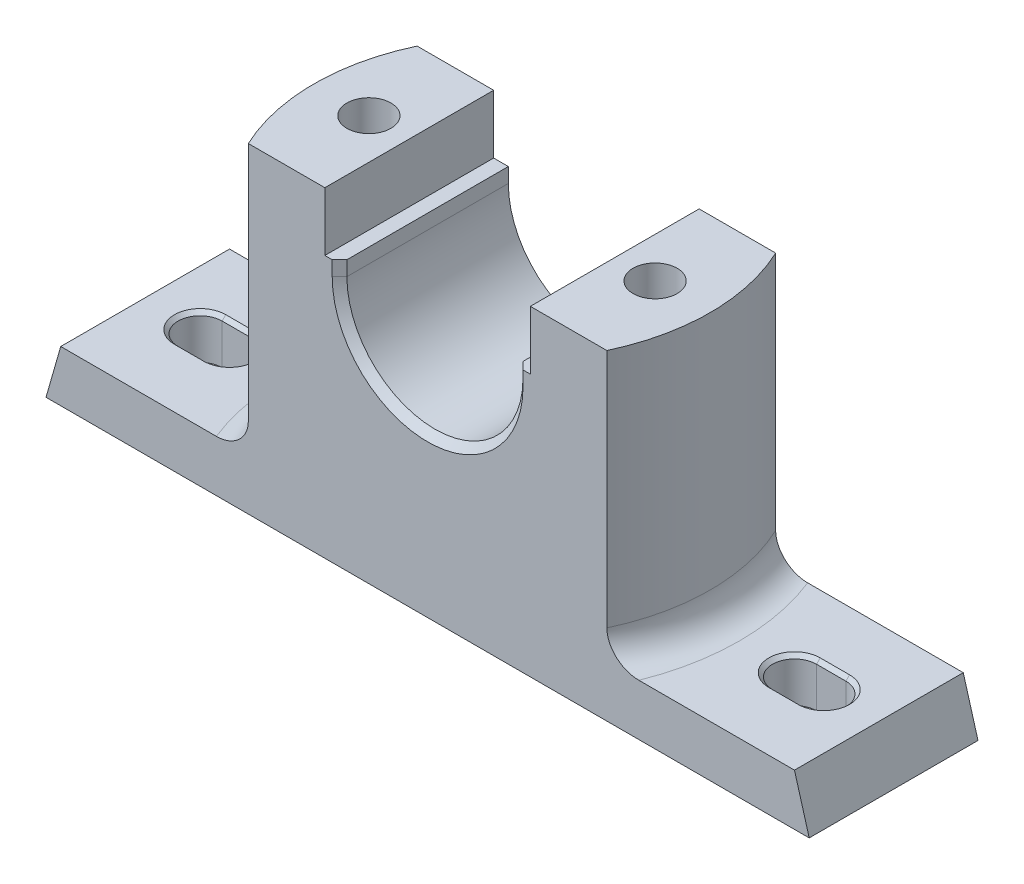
ISO-10303-21;
HEADER;
FILE_DESCRIPTION(('STEP AP214'),'2;1');
FILE_NAME('part.step','',(''),(''),'','','');
FILE_SCHEMA(('AUTOMOTIVE_DESIGN { 1 0 10303 214 1 1 1 1 }'));
ENDSEC;
DATA;
#1=APPLICATION_CONTEXT('core data for automotive mechanical design processes');
#2=APPLICATION_PROTOCOL_DEFINITION('international standard','automotive_design',2000,#1);
#3=PRODUCT_CONTEXT('',#1,'mechanical');
#4=PRODUCT('Part','Part','',(#3));
#5=PRODUCT_RELATED_PRODUCT_CATEGORY('part','',(#4));
#6=PRODUCT_DEFINITION_FORMATION('','',#4);
#7=PRODUCT_DEFINITION_CONTEXT('part definition',#1,'design');
#8=PRODUCT_DEFINITION('design','',#6,#7);
#9=PRODUCT_DEFINITION_SHAPE('','',#8);
#10=(LENGTH_UNIT() NAMED_UNIT(*) SI_UNIT(.MILLI.,.METRE.));
#11=(NAMED_UNIT(*) PLANE_ANGLE_UNIT() SI_UNIT($,.RADIAN.));
#12=(NAMED_UNIT(*) SI_UNIT($,.STERADIAN.) SOLID_ANGLE_UNIT());
#13=UNCERTAINTY_MEASURE_WITH_UNIT(LENGTH_MEASURE(1.E-05),#10,'distance_accuracy_value','');
#14=(GEOMETRIC_REPRESENTATION_CONTEXT(3) GLOBAL_UNCERTAINTY_ASSIGNED_CONTEXT((#13)) GLOBAL_UNIT_ASSIGNED_CONTEXT((#10,
#11,#12)) REPRESENTATION_CONTEXT('',''));
#15=CARTESIAN_POINT('',(0.,0.,0.));
#16=DIRECTION('',(0.,0.,1.));
#17=DIRECTION('',(1.,0.,0.));
#18=AXIS2_PLACEMENT_3D('',#15,#16,#17);
#19=CARTESIAN_POINT('',(0.,58.4117343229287,0.));
#20=DIRECTION('',(0.,-1.,0.));
#21=DIRECTION('',(1.,0.,0.));
#22=AXIS2_PLACEMENT_3D('',#19,#20,#21);
#23=PLANE('',#22);
#24=DIRECTION('',(0.,0.,1.));
#25=VECTOR('',#24,1.);
#26=CARTESIAN_POINT('',(258.47362811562,58.4117343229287,0.));
#27=LINE('',#26,#25);
#28=CARTESIAN_POINT('',(258.47362811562,58.4117343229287,-14.));
#29=VERTEX_POINT('',#28);
#30=CARTESIAN_POINT('',(258.47362811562,58.4117343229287,14.));
#31=VERTEX_POINT('',#30);
#32=EDGE_CURVE('E380',#29,#31,#27,.T.);
#33=ORIENTED_EDGE('',*,*,#32,.T.);
#34=DIRECTION('',(1.,0.,0.));
#35=VECTOR('',#34,1.);
#36=CARTESIAN_POINT('',(0.,58.4117343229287,14.));
#37=LINE('',#36,#35);
#38=CARTESIAN_POINT('',(286.47362811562,58.4117343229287,14.));
#39=VERTEX_POINT('',#38);
#40=EDGE_CURVE('E366',#31,#39,#37,.T.);
#41=ORIENTED_EDGE('',*,*,#40,.T.);
#42=DIRECTION('',(0.,0.,-1.));
#43=VECTOR('',#42,1.);
#44=CARTESIAN_POINT('',(286.47362811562,58.4117343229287,0.));
#45=LINE('',#44,#43);
#46=CARTESIAN_POINT('',(286.47362811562,58.4117343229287,-14.));
#47=VERTEX_POINT('',#46);
#48=EDGE_CURVE('E371',#39,#47,#45,.T.);
#49=ORIENTED_EDGE('',*,*,#48,.T.);
#50=DIRECTION('',(-1.,0.,0.));
#51=VECTOR('',#50,1.);
#52=CARTESIAN_POINT('',(0.,58.4117343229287,-14.));
#53=LINE('',#52,#51);
#54=EDGE_CURVE('E383',#47,#29,#53,.T.);
#55=ORIENTED_EDGE('',*,*,#54,.T.);
#56=EDGE_LOOP('',(#33,#41,#49,#55));
#57=FACE_BOUND('',#56,.T.);
#58=DIRECTION('',(-1.,0.,0.));
#59=VECTOR('',#58,1.);
#60=CARTESIAN_POINT('',(0.,58.4117343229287,14.));
#61=LINE('',#60,#59);
#62=CARTESIAN_POINT('',(208.47362811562,58.4117343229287,14.));
#63=VERTEX_POINT('',#62);
#64=CARTESIAN_POINT('',(180.47362811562,58.4117343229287,14.));
#65=VERTEX_POINT('',#64);
#66=EDGE_CURVE('E391',#63,#65,#61,.T.);
#67=ORIENTED_EDGE('',*,*,#66,.F.);
#68=DIRECTION('',(0.,0.,1.));
#69=VECTOR('',#68,1.);
#70=CARTESIAN_POINT('',(208.47362811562,58.4117343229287,0.));
#71=LINE('',#70,#69);
#72=CARTESIAN_POINT('',(208.47362811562,58.4117343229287,-14.));
#73=VERTEX_POINT('',#72);
#74=EDGE_CURVE('E402',#73,#63,#71,.T.);
#75=ORIENTED_EDGE('',*,*,#74,.F.);
#76=DIRECTION('',(1.,0.,0.));
#77=VECTOR('',#76,1.);
#78=CARTESIAN_POINT('',(0.,58.4117343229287,-14.));
#79=LINE('',#78,#77);
#80=CARTESIAN_POINT('',(180.47362811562,58.4117343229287,-14.));
#81=VERTEX_POINT('',#80);
#82=EDGE_CURVE('E416',#81,#73,#79,.T.);
#83=ORIENTED_EDGE('',*,*,#82,.F.);
#84=DIRECTION('',(0.,0.,-1.));
#85=VECTOR('',#84,1.);
#86=CARTESIAN_POINT('',(180.47362811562,58.4117343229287,0.));
#87=LINE('',#86,#85);
#88=EDGE_CURVE('E413',#65,#81,#87,.T.);
#89=ORIENTED_EDGE('',*,*,#88,.F.);
#90=EDGE_LOOP('',(#67,#75,#83,#89));
#91=FACE_BOUND('',#90,.T.);
#92=DIRECTION('',(0.,0.,-1.));
#93=VECTOR('',#92,1.);
#94=CARTESIAN_POINT('',(135.97362811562,58.4117343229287,17.5));
#95=LINE('',#94,#93);
#96=CARTESIAN_POINT('',(135.97362811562,58.4117343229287,17.5));
#97=VERTEX_POINT('',#96);
#98=CARTESIAN_POINT('',(135.97362811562,58.4117343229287,-17.5));
#99=VERTEX_POINT('',#98);
#100=EDGE_CURVE('E430',#97,#99,#95,.T.);
#101=ORIENTED_EDGE('',*,*,#100,.T.);
#102=DIRECTION('',(1.,0.,0.));
#103=VECTOR('',#102,1.);
#104=CARTESIAN_POINT('',(135.97362811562,58.4117343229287,-17.5));
#105=LINE('',#104,#103);
#106=CARTESIAN_POINT('',(330.97362811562,58.4117343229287,-17.5));
#107=VERTEX_POINT('',#106);
#108=EDGE_CURVE('E433',#99,#107,#105,.T.);
#109=ORIENTED_EDGE('',*,*,#108,.T.);
#110=DIRECTION('',(0.,0.,1.));
#111=VECTOR('',#110,1.);
#112=CARTESIAN_POINT('',(330.97362811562,58.4117343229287,17.5));
#113=LINE('',#112,#111);
#114=CARTESIAN_POINT('',(330.97362811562,58.4117343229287,17.5));
#115=VERTEX_POINT('',#114);
#116=EDGE_CURVE('E437',#107,#115,#113,.T.);
#117=ORIENTED_EDGE('',*,*,#116,.T.);
#118=DIRECTION('',(-1.,0.,0.));
#119=VECTOR('',#118,1.);
#120=CARTESIAN_POINT('',(135.97362811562,58.4117343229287,17.5));
#121=LINE('',#120,#119);
#122=EDGE_CURVE('E440',#115,#97,#121,.T.);
#123=ORIENTED_EDGE('',*,*,#122,.T.);
#124=EDGE_LOOP('',(#101,#109,#117,#123));
#125=FACE_BOUND('',#124,.T.);
#126=DIRECTION('',(-1.,0.,0.));
#127=VECTOR('',#126,1.);
#128=CARTESIAN_POINT('',(0.,58.4117343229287,6.00000000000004));
#129=LINE('',#128,#127);
#130=CARTESIAN_POINT('',(156.47362811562,58.4117343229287,6.00000000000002));
#131=VERTEX_POINT('',#130);
#132=CARTESIAN_POINT('',(148.47362811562,58.4117343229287,6.00000000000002));
#133=VERTEX_POINT('',#132);
#134=EDGE_CURVE('E364',#131,#133,#129,.T.);
#135=ORIENTED_EDGE('',*,*,#134,.F.);
#136=CARTESIAN_POINT('',(156.47362811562,58.4117343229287,0.));
#137=DIRECTION('',(0.,-1.,0.));
#138=DIRECTION('',(1.,0.,0.));
#139=AXIS2_PLACEMENT_3D('',#136,#137,#138);
#140=CIRCLE('',#139,6.);
#141=CARTESIAN_POINT('',(156.47362811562,58.4117343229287,-5.99999999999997));
#142=VERTEX_POINT('',#141);
#143=EDGE_CURVE('E352',#142,#131,#140,.T.);
#144=ORIENTED_EDGE('',*,*,#143,.F.);
#145=DIRECTION('',(-1.,0.,0.));
#146=VECTOR('',#145,1.);
#147=CARTESIAN_POINT('',(0.,58.4117343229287,-5.99999999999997));
#148=LINE('',#147,#146);
#149=CARTESIAN_POINT('',(148.47362811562,58.4117343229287,-5.99999999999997));
#150=VERTEX_POINT('',#149);
#151=EDGE_CURVE('E359',#142,#150,#148,.T.);
#152=ORIENTED_EDGE('',*,*,#151,.T.);
#153=CARTESIAN_POINT('',(148.47362811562,58.4117343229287,0.));
#154=DIRECTION('',(0.,-1.,0.));
#155=DIRECTION('',(1.,0.,0.));
#156=AXIS2_PLACEMENT_3D('',#153,#154,#155);
#157=CIRCLE('',#156,6.);
#158=EDGE_CURVE('E362',#133,#150,#157,.T.);
#159=ORIENTED_EDGE('',*,*,#158,.F.);
#160=EDGE_LOOP('',(#135,#144,#152,#159));
#161=FACE_BOUND('',#160,.T.);
#162=DIRECTION('',(1.,0.,0.));
#163=VECTOR('',#162,1.);
#164=CARTESIAN_POINT('',(0.,58.4117343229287,-5.99999999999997));
#165=LINE('',#164,#163);
#166=CARTESIAN_POINT('',(310.47362811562,58.4117343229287,-5.99999999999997));
#167=VERTEX_POINT('',#166);
#168=CARTESIAN_POINT('',(318.47362811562,58.4117343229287,-5.99999999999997));
#169=VERTEX_POINT('',#168);
#170=EDGE_CURVE('E340',#167,#169,#165,.T.);
#171=ORIENTED_EDGE('',*,*,#170,.F.);
#172=CARTESIAN_POINT('',(310.47362811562,58.4117343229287,0.));
#173=DIRECTION('',(0.,-1.,0.));
#174=DIRECTION('',(1.,0.,0.));
#175=AXIS2_PLACEMENT_3D('',#172,#173,#174);
#176=CIRCLE('',#175,6.);
#177=CARTESIAN_POINT('',(310.47362811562,58.4117343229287,6.00000000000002));
#178=VERTEX_POINT('',#177);
#179=EDGE_CURVE('E333',#167,#178,#176,.F.);
#180=ORIENTED_EDGE('',*,*,#179,.T.);
#181=DIRECTION('',(1.,0.,0.));
#182=VECTOR('',#181,1.);
#183=CARTESIAN_POINT('',(0.,58.4117343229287,5.99999999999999));
#184=LINE('',#183,#182);
#185=CARTESIAN_POINT('',(318.47362811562,58.4117343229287,6.00000000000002));
#186=VERTEX_POINT('',#185);
#187=EDGE_CURVE('E315',#178,#186,#184,.T.);
#188=ORIENTED_EDGE('',*,*,#187,.T.);
#189=CARTESIAN_POINT('',(318.47362811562,58.4117343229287,0.));
#190=DIRECTION('',(0.,-1.,0.));
#191=DIRECTION('',(1.,0.,0.));
#192=AXIS2_PLACEMENT_3D('',#189,#190,#191);
#193=CIRCLE('',#192,6.);
#194=EDGE_CURVE('E327',#186,#169,#193,.F.);
#195=ORIENTED_EDGE('',*,*,#194,.T.);
#196=EDGE_LOOP('',(#171,#180,#188,#195));
#197=FACE_BOUND('',#196,.T.);
#198=ADVANCED_FACE('F33',(#57,#91,#125,#161,#197),#23,.T.);
#199=CARTESIAN_POINT('',(333.459192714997,70.4117343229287,23.));
#200=DIRECTION('',(0.,-1.,0.));
#201=DIRECTION('',(1.,0.,0.));
#202=AXIS2_PLACEMENT_3D('',#199,#200,#201);
#203=PLANE('',#202);
#204=CARTESIAN_POINT('',(318.47362811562,70.4117343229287,0.));
#205=DIRECTION('',(0.,-1.,0.));
#206=DIRECTION('',(1.,0.,0.));
#207=AXIS2_PLACEMENT_3D('',#204,#205,#206);
#208=CIRCLE('',#207,7.);
#209=CARTESIAN_POINT('',(318.47362811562,70.4117343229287,-6.99999999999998));
#210=VERTEX_POINT('',#209);
#211=CARTESIAN_POINT('',(318.47362811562,70.4117343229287,7.00000000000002));
#212=VERTEX_POINT('',#211);
#213=EDGE_CURVE('E865',#210,#212,#208,.T.);
#214=ORIENTED_EDGE('',*,*,#213,.T.);
#215=DIRECTION('',(-1.,0.,0.));
#216=VECTOR('',#215,1.);
#217=CARTESIAN_POINT('',(310.47362811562,70.4117343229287,7.00000000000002));
#218=LINE('',#217,#216);
#219=CARTESIAN_POINT('',(310.47362811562,70.4117343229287,7.00000000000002));
#220=VERTEX_POINT('',#219);
#221=EDGE_CURVE('E906',#212,#220,#218,.T.);
#222=ORIENTED_EDGE('',*,*,#221,.T.);
#223=CARTESIAN_POINT('',(310.47362811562,70.4117343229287,0.));
#224=DIRECTION('',(0.,-1.,0.));
#225=DIRECTION('',(1.,0.,0.));
#226=AXIS2_PLACEMENT_3D('',#223,#224,#225);
#227=CIRCLE('',#226,6.99999999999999);
#228=CARTESIAN_POINT('',(310.47362811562,70.4117343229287,-6.99999999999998));
#229=VERTEX_POINT('',#228);
#230=EDGE_CURVE('E909',#220,#229,#227,.T.);
#231=ORIENTED_EDGE('',*,*,#230,.T.);
#232=DIRECTION('',(1.,0.,0.));
#233=VECTOR('',#232,1.);
#234=CARTESIAN_POINT('',(333.459192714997,70.4117343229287,-6.99999999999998));
#235=LINE('',#234,#233);
#236=EDGE_CURVE('E611',#229,#210,#235,.T.);
#237=ORIENTED_EDGE('',*,*,#236,.T.);
#238=EDGE_LOOP('',(#214,#222,#231,#237));
#239=FACE_BOUND('',#238,.T.);
#240=DIRECTION('',(-1.,0.,0.));
#241=VECTOR('',#240,1.);
#242=CARTESIAN_POINT('',(333.459192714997,70.4117343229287,-23.));
#243=LINE('',#242,#241);
#244=CARTESIAN_POINT('',(333.459192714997,70.4117343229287,-23.));
#245=VERTEX_POINT('',#244);
#246=CARTESIAN_POINT('',(291.04966479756,70.4117343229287,-23.));
#247=VERTEX_POINT('',#246);
#248=EDGE_CURVE('E475',#245,#247,#243,.T.);
#249=ORIENTED_EDGE('',*,*,#248,.T.);
#250=CARTESIAN_POINT('',(233.47362811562,70.4117343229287,0.));
#251=DIRECTION('',(0.,-1.,0.));
#252=DIRECTION('',(1.,0.,0.));
#253=AXIS2_PLACEMENT_3D('',#250,#251,#252);
#254=CIRCLE('',#253,62.);
#255=CARTESIAN_POINT('',(291.04966479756,70.4117343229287,23.));
#256=VERTEX_POINT('',#255);
#257=EDGE_CURVE('E574',#247,#256,#254,.T.);
#258=ORIENTED_EDGE('',*,*,#257,.T.);
#259=DIRECTION('',(-1.,0.,0.));
#260=VECTOR('',#259,1.);
#261=CARTESIAN_POINT('',(333.459192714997,70.4117343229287,23.));
#262=LINE('',#261,#260);
#263=CARTESIAN_POINT('',(333.459192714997,70.4117343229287,23.));
#264=VERTEX_POINT('',#263);
#265=EDGE_CURVE('E476',#264,#256,#262,.T.);
#266=ORIENTED_EDGE('',*,*,#265,.F.);
#267=DIRECTION('',(0.,0.,-1.));
#268=VECTOR('',#267,1.);
#269=CARTESIAN_POINT('',(333.459192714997,70.4117343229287,23.));
#270=LINE('',#269,#268);
#271=EDGE_CURVE('E502',#264,#245,#270,.T.);
#272=ORIENTED_EDGE('',*,*,#271,.T.);
#273=EDGE_LOOP('',(#249,#258,#266,#272));
#274=FACE_BOUND('',#273,.T.);
#275=ADVANCED_FACE('F669',(#239,#274),#203,.F.);
#276=CARTESIAN_POINT('',(287.47362811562,143.882177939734,23.));
#277=DIRECTION('',(0.,-1.,0.));
#278=DIRECTION('',(0.,0.,-1.));
#279=AXIS2_PLACEMENT_3D('',#276,#277,#278);
#280=PLANE('',#279);
#281=CARTESIAN_POINT('',(272.47362811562,143.882177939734,0.));
#282=DIRECTION('',(0.,1.,0.));
#283=DIRECTION('',(0.,0.,1.));
#284=AXIS2_PLACEMENT_3D('',#281,#282,#283);
#285=CIRCLE('',#284,5.99999999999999);
#286=CARTESIAN_POINT('',(272.47362811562,143.882177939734,5.99999999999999));
#287=VERTEX_POINT('',#286);
#288=EDGE_CURVE('E792',#287,#287,#285,.T.);
#289=ORIENTED_EDGE('',*,*,#288,.F.);
#290=EDGE_LOOP('',(#289));
#291=FACE_BOUND('',#290,.T.);
#292=CARTESIAN_POINT('',(233.47362811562,143.882177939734,0.));
#293=DIRECTION('',(0.,1.,0.));
#294=DIRECTION('',(0.,0.,1.));
#295=AXIS2_PLACEMENT_3D('',#292,#293,#294);
#296=CIRCLE('',#295,54.);
#297=CARTESIAN_POINT('',(282.330562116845,143.882177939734,23.));
#298=VERTEX_POINT('',#297);
#299=CARTESIAN_POINT('',(282.330562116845,143.882177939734,-23.));
#300=VERTEX_POINT('',#299);
#301=EDGE_CURVE('E462',#298,#300,#296,.T.);
#302=ORIENTED_EDGE('',*,*,#301,.T.);
#303=DIRECTION('',(-1.,0.,0.));
#304=VECTOR('',#303,1.);
#305=CARTESIAN_POINT('',(287.47362811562,143.882177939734,-23.));
#306=LINE('',#305,#304);
#307=CARTESIAN_POINT('',(261.47362811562,143.882177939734,-23.));
#308=VERTEX_POINT('',#307);
#309=EDGE_CURVE('E505',#300,#308,#306,.T.);
#310=ORIENTED_EDGE('',*,*,#309,.T.);
#311=DIRECTION('',(0.,0.,-1.));
#312=VECTOR('',#311,1.);
#313=CARTESIAN_POINT('',(261.47362811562,143.882177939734,23.));
#314=LINE('',#313,#312);
#315=CARTESIAN_POINT('',(261.47362811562,143.882177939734,23.));
#316=VERTEX_POINT('',#315);
#317=EDGE_CURVE('E563',#316,#308,#314,.T.);
#318=ORIENTED_EDGE('',*,*,#317,.F.);
#319=DIRECTION('',(-1.,0.,0.));
#320=VECTOR('',#319,1.);
#321=CARTESIAN_POINT('',(287.47362811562,143.882177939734,23.));
#322=LINE('',#321,#320);
#323=EDGE_CURVE('E479',#298,#316,#322,.T.);
#324=ORIENTED_EDGE('',*,*,#323,.F.);
#325=EDGE_LOOP('',(#302,#310,#318,#324));
#326=FACE_BOUND('',#325,.T.);
#327=ADVANCED_FACE('F675',(#291,#326),#280,.F.);
#328=CARTESIAN_POINT('',(179.47362811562,143.882177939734,23.));
#329=DIRECTION('',(0.,-1.,0.));
#330=DIRECTION('',(0.,0.,-1.));
#331=AXIS2_PLACEMENT_3D('',#328,#329,#330);
#332=PLANE('',#331);
#333=CARTESIAN_POINT('',(194.47362811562,143.882177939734,0.));
#334=DIRECTION('',(0.,1.,0.));
#335=DIRECTION('',(0.,0.,1.));
#336=AXIS2_PLACEMENT_3D('',#333,#334,#335);
#337=CIRCLE('',#336,6.00000000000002);
#338=CARTESIAN_POINT('',(194.47362811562,143.882177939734,6.00000000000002));
#339=VERTEX_POINT('',#338);
#340=EDGE_CURVE('E832',#339,#339,#337,.T.);
#341=ORIENTED_EDGE('',*,*,#340,.F.);
#342=EDGE_LOOP('',(#341));
#343=FACE_BOUND('',#342,.T.);
#344=CARTESIAN_POINT('',(233.47362811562,143.882177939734,0.));
#345=DIRECTION('',(0.,1.,0.));
#346=DIRECTION('',(0.,0.,1.));
#347=AXIS2_PLACEMENT_3D('',#344,#345,#346);
#348=CIRCLE('',#347,54.);
#349=CARTESIAN_POINT('',(184.616694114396,143.882177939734,-23.));
#350=VERTEX_POINT('',#349);
#351=CARTESIAN_POINT('',(184.616694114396,143.882177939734,23.));
#352=VERTEX_POINT('',#351);
#353=EDGE_CURVE('E467',#350,#352,#348,.T.);
#354=ORIENTED_EDGE('',*,*,#353,.T.);
#355=DIRECTION('',(-1.,0.,0.));
#356=VECTOR('',#355,1.);
#357=CARTESIAN_POINT('',(179.47362811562,143.882177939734,23.));
#358=LINE('',#357,#356);
#359=CARTESIAN_POINT('',(205.47362811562,143.882177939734,23.));
#360=VERTEX_POINT('',#359);
#361=EDGE_CURVE('E491',#360,#352,#358,.T.);
#362=ORIENTED_EDGE('',*,*,#361,.F.);
#363=DIRECTION('',(0.,0.,-1.));
#364=VECTOR('',#363,1.);
#365=CARTESIAN_POINT('',(205.47362811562,143.882177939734,23.));
#366=LINE('',#365,#364);
#367=CARTESIAN_POINT('',(205.47362811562,143.882177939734,-23.));
#368=VERTEX_POINT('',#367);
#369=EDGE_CURVE('E546',#360,#368,#366,.T.);
#370=ORIENTED_EDGE('',*,*,#369,.T.);
#371=DIRECTION('',(-1.,0.,0.));
#372=VECTOR('',#371,1.);
#373=CARTESIAN_POINT('',(179.47362811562,143.882177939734,-23.));
#374=LINE('',#373,#372);
#375=EDGE_CURVE('E525',#368,#350,#374,.T.);
#376=ORIENTED_EDGE('',*,*,#375,.T.);
#377=EDGE_LOOP('',(#354,#362,#370,#376));
#378=FACE_BOUND('',#377,.T.);
#379=ADVANCED_FACE('F756',(#343,#378),#332,.F.);
#380=CARTESIAN_POINT('',(261.47362811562,143.882177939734,23.));
#381=DIRECTION('',(1.,0.,0.));
#382=DIRECTION('',(0.,0.,-1.));
#383=AXIS2_PLACEMENT_3D('',#380,#381,#382);
#384=PLANE('',#383);
#385=DIRECTION('',(0.,-1.,0.));
#386=VECTOR('',#385,1.);
#387=CARTESIAN_POINT('',(261.47362811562,143.882177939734,-23.));
#388=LINE('',#387,#386);
#389=CARTESIAN_POINT('',(261.47362811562,127.882177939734,-23.));
#390=VERTEX_POINT('',#389);
#391=EDGE_CURVE('E507',#308,#390,#388,.T.);
#392=ORIENTED_EDGE('',*,*,#391,.T.);
#393=DIRECTION('',(0.,0.,-1.));
#394=VECTOR('',#393,1.);
#395=CARTESIAN_POINT('',(261.47362811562,127.882177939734,23.));
#396=LINE('',#395,#394);
#397=CARTESIAN_POINT('',(261.47362811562,127.882177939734,23.));
#398=VERTEX_POINT('',#397);
#399=EDGE_CURVE('E560',#398,#390,#396,.T.);
#400=ORIENTED_EDGE('',*,*,#399,.F.);
#401=DIRECTION('',(0.,-1.,0.));
#402=VECTOR('',#401,1.);
#403=CARTESIAN_POINT('',(261.47362811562,143.882177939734,23.));
#404=LINE('',#403,#402);
#405=EDGE_CURVE('E482',#316,#398,#404,.T.);
#406=ORIENTED_EDGE('',*,*,#405,.F.);
#407=ORIENTED_EDGE('',*,*,#317,.T.);
#408=EDGE_LOOP('',(#392,#400,#406,#407));
#409=FACE_BOUND('',#408,.T.);
#410=ADVANCED_FACE('F759',(#409),#384,.F.);
#411=CARTESIAN_POINT('',(261.47362811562,127.882177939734,23.));
#412=DIRECTION('',(0.,-1.,0.));
#413=DIRECTION('',(0.,0.,-1.));
#414=AXIS2_PLACEMENT_3D('',#411,#412,#413);
#415=PLANE('',#414);
#416=DIRECTION('',(0.,0.,-1.));
#417=VECTOR('',#416,1.);
#418=CARTESIAN_POINT('',(257.47362811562,127.882177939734,23.));
#419=LINE('',#418,#417);
#420=CARTESIAN_POINT('',(257.47362811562,127.882177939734,21.));
#421=VERTEX_POINT('',#420);
#422=CARTESIAN_POINT('',(257.47362811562,127.882177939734,-23.));
#423=VERTEX_POINT('',#422);
#424=EDGE_CURVE('E558',#421,#423,#419,.T.);
#425=ORIENTED_EDGE('',*,*,#424,.F.);
#426=DIRECTION('',(0.707106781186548,0.,0.707106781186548));
#427=VECTOR('',#426,1.);
#428=CARTESIAN_POINT('',(259.47362811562,127.882177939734,23.));
#429=LINE('',#428,#427);
#430=CARTESIAN_POINT('',(259.47362811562,127.882177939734,23.));
#431=VERTEX_POINT('',#430);
#432=EDGE_CURVE('E12',#421,#431,#429,.T.);
#433=ORIENTED_EDGE('',*,*,#432,.T.);
#434=DIRECTION('',(-1.,0.,0.));
#435=VECTOR('',#434,1.);
#436=CARTESIAN_POINT('',(261.47362811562,127.882177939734,23.));
#437=LINE('',#436,#435);
#438=EDGE_CURVE('E484',#398,#431,#437,.T.);
#439=ORIENTED_EDGE('',*,*,#438,.F.);
#440=ORIENTED_EDGE('',*,*,#399,.T.);
#441=DIRECTION('',(-1.,0.,0.));
#442=VECTOR('',#441,1.);
#443=CARTESIAN_POINT('',(261.47362811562,127.882177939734,-23.));
#444=LINE('',#443,#442);
#445=EDGE_CURVE('E509',#390,#423,#444,.T.);
#446=ORIENTED_EDGE('',*,*,#445,.T.);
#447=EDGE_LOOP('',(#425,#433,#439,#440,#446));
#448=FACE_BOUND('',#447,.T.);
#449=ADVANCED_FACE('F778',(#448),#415,.F.);
#450=CARTESIAN_POINT('',(257.47362811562,127.882177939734,23.));
#451=DIRECTION('',(1.,0.,0.));
#452=DIRECTION('',(0.,0.,-1.));
#453=AXIS2_PLACEMENT_3D('',#450,#451,#452);
#454=PLANE('',#453);
#455=DIRECTION('',(0.,0.,-1.));
#456=VECTOR('',#455,1.);
#457=CARTESIAN_POINT('',(257.47362811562,123.882177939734,23.));
#458=LINE('',#457,#456);
#459=CARTESIAN_POINT('',(257.47362811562,123.882177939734,21.));
#460=VERTEX_POINT('',#459);
#461=CARTESIAN_POINT('',(257.47362811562,123.882177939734,-23.));
#462=VERTEX_POINT('',#461);
#463=EDGE_CURVE('E556',#460,#462,#458,.T.);
#464=ORIENTED_EDGE('',*,*,#463,.F.);
#465=DIRECTION('',(0.,1.,0.));
#466=VECTOR('',#465,1.);
#467=CARTESIAN_POINT('',(257.47362811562,127.882177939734,21.));
#468=LINE('',#467,#466);
#469=EDGE_CURVE('E42',#460,#421,#468,.T.);
#470=ORIENTED_EDGE('',*,*,#469,.T.);
#471=ORIENTED_EDGE('',*,*,#424,.T.);
#472=DIRECTION('',(0.,-1.,0.));
#473=VECTOR('',#472,1.);
#474=CARTESIAN_POINT('',(257.47362811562,127.882177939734,-23.));
#475=LINE('',#474,#473);
#476=EDGE_CURVE('E512',#423,#462,#475,.T.);
#477=ORIENTED_EDGE('',*,*,#476,.T.);
#478=EDGE_LOOP('',(#464,#470,#471,#477));
#479=FACE_BOUND('',#478,.T.);
#480=ADVANCED_FACE('F775',(#479),#454,.F.);
#481=CARTESIAN_POINT('',(233.47362811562,123.882177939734,23.));
#482=DIRECTION('',(0.,0.,-1.));
#483=DIRECTION('',(-1.,0.,0.));
#484=AXIS2_PLACEMENT_3D('',#481,#482,#483);
#485=CYLINDRICAL_SURFACE('',#484,24.);
#486=DIRECTION('',(0.,0.,-1.));
#487=VECTOR('',#486,1.);
#488=CARTESIAN_POINT('',(209.47362811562,123.882177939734,23.));
#489=LINE('',#488,#487);
#490=CARTESIAN_POINT('',(209.47362811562,123.882177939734,21.));
#491=VERTEX_POINT('',#490);
#492=CARTESIAN_POINT('',(209.47362811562,123.882177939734,-23.));
#493=VERTEX_POINT('',#492);
#494=EDGE_CURVE('E554',#491,#493,#489,.T.);
#495=ORIENTED_EDGE('',*,*,#494,.F.);
#496=CARTESIAN_POINT('',(233.47362811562,123.882177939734,21.));
#497=DIRECTION('',(0.,0.,1.));
#498=DIRECTION('',(1.,0.,0.));
#499=AXIS2_PLACEMENT_3D('',#496,#497,#498);
#500=CIRCLE('',#499,24.);
#501=EDGE_CURVE('E57',#491,#460,#500,.T.);
#502=ORIENTED_EDGE('',*,*,#501,.T.);
#503=ORIENTED_EDGE('',*,*,#463,.T.);
#504=CARTESIAN_POINT('',(233.47362811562,123.882177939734,-23.));
#505=DIRECTION('',(0.,0.,-1.));
#506=DIRECTION('',(1.,0.,0.));
#507=AXIS2_PLACEMENT_3D('',#504,#505,#506);
#508=CIRCLE('',#507,24.);
#509=EDGE_CURVE('E515',#462,#493,#508,.T.);
#510=ORIENTED_EDGE('',*,*,#509,.T.);
#511=EDGE_LOOP('',(#495,#502,#503,#510));
#512=FACE_BOUND('',#511,.T.);
#513=ADVANCED_FACE('F771',(#512),#485,.F.);
#514=CARTESIAN_POINT('',(209.47362811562,127.882177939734,23.));
#515=DIRECTION('',(-1.,0.,0.));
#516=DIRECTION('',(0.,-1.,0.));
#517=AXIS2_PLACEMENT_3D('',#514,#515,#516);
#518=PLANE('',#517);
#519=DIRECTION('',(0.,0.,-1.));
#520=VECTOR('',#519,1.);
#521=CARTESIAN_POINT('',(209.47362811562,127.882177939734,23.));
#522=LINE('',#521,#520);
#523=CARTESIAN_POINT('',(209.47362811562,127.882177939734,21.));
#524=VERTEX_POINT('',#523);
#525=CARTESIAN_POINT('',(209.47362811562,127.882177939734,-23.));
#526=VERTEX_POINT('',#525);
#527=EDGE_CURVE('E552',#524,#526,#522,.T.);
#528=ORIENTED_EDGE('',*,*,#527,.F.);
#529=DIRECTION('',(0.,-1.,0.));
#530=VECTOR('',#529,1.);
#531=CARTESIAN_POINT('',(209.47362811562,123.882177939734,21.));
#532=LINE('',#531,#530);
#533=EDGE_CURVE('E822',#524,#491,#532,.T.);
#534=ORIENTED_EDGE('',*,*,#533,.T.);
#535=ORIENTED_EDGE('',*,*,#494,.T.);
#536=DIRECTION('',(0.,1.,0.));
#537=VECTOR('',#536,1.);
#538=CARTESIAN_POINT('',(209.47362811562,127.882177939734,-23.));
#539=LINE('',#538,#537);
#540=EDGE_CURVE('E518',#493,#526,#539,.T.);
#541=ORIENTED_EDGE('',*,*,#540,.T.);
#542=EDGE_LOOP('',(#528,#534,#535,#541));
#543=FACE_BOUND('',#542,.T.);
#544=ADVANCED_FACE('F767',(#543),#518,.F.);
#545=CARTESIAN_POINT('',(205.47362811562,127.882177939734,23.));
#546=DIRECTION('',(0.,-1.,0.));
#547=DIRECTION('',(0.,0.,-1.));
#548=AXIS2_PLACEMENT_3D('',#545,#546,#547);
#549=PLANE('',#548);
#550=DIRECTION('',(-1.,0.,0.));
#551=VECTOR('',#550,1.);
#552=CARTESIAN_POINT('',(205.47362811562,127.882177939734,23.));
#553=LINE('',#552,#551);
#554=CARTESIAN_POINT('',(207.47362811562,127.882177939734,23.));
#555=VERTEX_POINT('',#554);
#556=CARTESIAN_POINT('',(205.47362811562,127.882177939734,23.));
#557=VERTEX_POINT('',#556);
#558=EDGE_CURVE('E487',#555,#557,#553,.T.);
#559=ORIENTED_EDGE('',*,*,#558,.F.);
#560=DIRECTION('',(0.707106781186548,0.,-0.707106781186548));
#561=VECTOR('',#560,1.);
#562=CARTESIAN_POINT('',(207.47362811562,127.882177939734,23.));
#563=LINE('',#562,#561);
#564=EDGE_CURVE('E820',#555,#524,#563,.T.);
#565=ORIENTED_EDGE('',*,*,#564,.T.);
#566=ORIENTED_EDGE('',*,*,#527,.T.);
#567=DIRECTION('',(-1.,0.,0.));
#568=VECTOR('',#567,1.);
#569=CARTESIAN_POINT('',(205.47362811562,127.882177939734,-23.));
#570=LINE('',#569,#568);
#571=CARTESIAN_POINT('',(205.47362811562,127.882177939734,-23.));
#572=VERTEX_POINT('',#571);
#573=EDGE_CURVE('E521',#526,#572,#570,.T.);
#574=ORIENTED_EDGE('',*,*,#573,.T.);
#575=DIRECTION('',(0.,0.,-1.));
#576=VECTOR('',#575,1.);
#577=CARTESIAN_POINT('',(205.47362811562,127.882177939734,23.));
#578=LINE('',#577,#576);
#579=EDGE_CURVE('E549',#557,#572,#578,.T.);
#580=ORIENTED_EDGE('',*,*,#579,.F.);
#581=EDGE_LOOP('',(#559,#565,#566,#574,#580));
#582=FACE_BOUND('',#581,.T.);
#583=ADVANCED_FACE('F763',(#582),#549,.F.);
#584=CARTESIAN_POINT('',(205.47362811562,143.882177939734,23.));
#585=DIRECTION('',(-1.,0.,0.));
#586=DIRECTION('',(0.,0.,1.));
#587=AXIS2_PLACEMENT_3D('',#584,#585,#586);
#588=PLANE('',#587);
#589=DIRECTION('',(0.,1.,0.));
#590=VECTOR('',#589,1.);
#591=CARTESIAN_POINT('',(205.47362811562,143.882177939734,-23.));
#592=LINE('',#591,#590);
#593=EDGE_CURVE('E523',#572,#368,#592,.T.);
#594=ORIENTED_EDGE('',*,*,#593,.T.);
#595=ORIENTED_EDGE('',*,*,#369,.F.);
#596=DIRECTION('',(0.,1.,0.));
#597=VECTOR('',#596,1.);
#598=CARTESIAN_POINT('',(205.47362811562,143.882177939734,23.));
#599=LINE('',#598,#597);
#600=EDGE_CURVE('E489',#557,#360,#599,.T.);
#601=ORIENTED_EDGE('',*,*,#600,.F.);
#602=ORIENTED_EDGE('',*,*,#579,.T.);
#603=EDGE_LOOP('',(#594,#595,#601,#602));
#604=FACE_BOUND('',#603,.T.);
#605=ADVANCED_FACE('F754',(#604),#588,.F.);
#606=CARTESIAN_POINT('',(133.488063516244,70.4117343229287,23.));
#607=DIRECTION('',(0.,-1.,0.));
#608=DIRECTION('',(0.,0.,-1.));
#609=AXIS2_PLACEMENT_3D('',#606,#607,#608);
#610=PLANE('',#609);
#611=CARTESIAN_POINT('',(156.47362811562,70.4117343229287,0.));
#612=DIRECTION('',(0.,-1.,0.));
#613=DIRECTION('',(0.,0.,-1.));
#614=AXIS2_PLACEMENT_3D('',#611,#612,#613);
#615=CIRCLE('',#614,7.);
#616=CARTESIAN_POINT('',(156.47362811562,70.4117343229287,-6.99999999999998));
#617=VERTEX_POINT('',#616);
#618=CARTESIAN_POINT('',(156.47362811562,70.4117343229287,7.00000000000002));
#619=VERTEX_POINT('',#618);
#620=EDGE_CURVE('E896',#617,#619,#615,.T.);
#621=ORIENTED_EDGE('',*,*,#620,.T.);
#622=DIRECTION('',(-1.,0.,0.));
#623=VECTOR('',#622,1.);
#624=CARTESIAN_POINT('',(133.488063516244,70.4117343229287,7.00000000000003));
#625=LINE('',#624,#623);
#626=CARTESIAN_POINT('',(148.47362811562,70.4117343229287,7.00000000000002));
#627=VERTEX_POINT('',#626);
#628=EDGE_CURVE('E891',#619,#627,#625,.T.);
#629=ORIENTED_EDGE('',*,*,#628,.T.);
#630=CARTESIAN_POINT('',(148.47362811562,70.4117343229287,0.));
#631=DIRECTION('',(0.,-1.,0.));
#632=DIRECTION('',(0.,0.,-1.));
#633=AXIS2_PLACEMENT_3D('',#630,#631,#632);
#634=CIRCLE('',#633,7.);
#635=CARTESIAN_POINT('',(148.47362811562,70.4117343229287,-6.99999999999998));
#636=VERTEX_POINT('',#635);
#637=EDGE_CURVE('E894',#627,#636,#634,.T.);
#638=ORIENTED_EDGE('',*,*,#637,.T.);
#639=DIRECTION('',(1.,0.,0.));
#640=VECTOR('',#639,1.);
#641=CARTESIAN_POINT('',(156.47362811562,70.4117343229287,-6.99999999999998));
#642=LINE('',#641,#640);
#643=EDGE_CURVE('E898',#636,#617,#642,.T.);
#644=ORIENTED_EDGE('',*,*,#643,.T.);
#645=EDGE_LOOP('',(#621,#629,#638,#644));
#646=FACE_BOUND('',#645,.T.);
#647=DIRECTION('',(-1.,0.,0.));
#648=VECTOR('',#647,1.);
#649=CARTESIAN_POINT('',(133.488063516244,70.4117343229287,23.));
#650=LINE('',#649,#648);
#651=CARTESIAN_POINT('',(175.897591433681,70.4117343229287,23.));
#652=VERTEX_POINT('',#651);
#653=CARTESIAN_POINT('',(133.488063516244,70.4117343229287,23.));
#654=VERTEX_POINT('',#653);
#655=EDGE_CURVE('E494',#652,#654,#650,.T.);
#656=ORIENTED_EDGE('',*,*,#655,.F.);
#657=CARTESIAN_POINT('',(233.47362811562,70.4117343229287,0.));
#658=DIRECTION('',(0.,-1.,0.));
#659=DIRECTION('',(0.,0.,-1.));
#660=AXIS2_PLACEMENT_3D('',#657,#658,#659);
#661=CIRCLE('',#660,62.);
#662=CARTESIAN_POINT('',(175.897591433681,70.4117343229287,-23.));
#663=VERTEX_POINT('',#662);
#664=EDGE_CURVE('E569',#652,#663,#661,.T.);
#665=ORIENTED_EDGE('',*,*,#664,.T.);
#666=DIRECTION('',(-1.,0.,0.));
#667=VECTOR('',#666,1.);
#668=CARTESIAN_POINT('',(133.488063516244,70.4117343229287,-23.));
#669=LINE('',#668,#667);
#670=CARTESIAN_POINT('',(133.488063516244,70.4117343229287,-23.));
#671=VERTEX_POINT('',#670);
#672=EDGE_CURVE('E528',#663,#671,#669,.T.);
#673=ORIENTED_EDGE('',*,*,#672,.T.);
#674=DIRECTION('',(0.,0.,-1.));
#675=VECTOR('',#674,1.);
#676=CARTESIAN_POINT('',(133.488063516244,70.4117343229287,23.));
#677=LINE('',#676,#675);
#678=EDGE_CURVE('E543',#654,#671,#677,.T.);
#679=ORIENTED_EDGE('',*,*,#678,.F.);
#680=EDGE_LOOP('',(#656,#665,#673,#679));
#681=FACE_BOUND('',#680,.T.);
#682=ADVANCED_FACE('F727',(#646,#681),#610,.F.);
#683=CARTESIAN_POINT('',(129.47362811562,56.4117343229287,23.));
#684=DIRECTION('',(0.961261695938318,-0.275637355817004,0.));
#685=DIRECTION('',(0.275637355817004,0.961261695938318,0.));
#686=AXIS2_PLACEMENT_3D('',#683,#684,#685);
#687=PLANE('',#686);
#688=DIRECTION('',(-0.275637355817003,-0.961261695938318,0.));
#689=VECTOR('',#688,1.);
#690=CARTESIAN_POINT('',(129.47362811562,56.4117343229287,-23.));
#691=LINE('',#690,#689);
#692=CARTESIAN_POINT('',(129.47362811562,56.4117343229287,-23.));
#693=VERTEX_POINT('',#692);
#694=EDGE_CURVE('E530',#671,#693,#691,.T.);
#695=ORIENTED_EDGE('',*,*,#694,.T.);
#696=DIRECTION('',(0.,0.,-1.));
#697=VECTOR('',#696,1.);
#698=CARTESIAN_POINT('',(129.47362811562,56.4117343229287,23.));
#699=LINE('',#698,#697);
#700=CARTESIAN_POINT('',(129.47362811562,56.4117343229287,23.));
#701=VERTEX_POINT('',#700);
#702=EDGE_CURVE('E540',#701,#693,#699,.T.);
#703=ORIENTED_EDGE('',*,*,#702,.F.);
#704=DIRECTION('',(-0.275637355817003,-0.961261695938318,0.));
#705=VECTOR('',#704,1.);
#706=CARTESIAN_POINT('',(129.47362811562,56.4117343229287,23.));
#707=LINE('',#706,#705);
#708=EDGE_CURVE('E496',#654,#701,#707,.T.);
#709=ORIENTED_EDGE('',*,*,#708,.F.);
#710=ORIENTED_EDGE('',*,*,#678,.T.);
#711=EDGE_LOOP('',(#695,#703,#709,#710));
#712=FACE_BOUND('',#711,.T.);
#713=ADVANCED_FACE('F731',(#712),#687,.F.);
#714=CARTESIAN_POINT('',(337.47362811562,56.4117343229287,23.));
#715=DIRECTION('',(0.,1.,0.));
#716=DIRECTION('',(-1.,0.,0.));
#717=AXIS2_PLACEMENT_3D('',#714,#715,#716);
#718=PLANE('',#717);
#719=DIRECTION('',(1.,0.,0.));
#720=VECTOR('',#719,1.);
#721=CARTESIAN_POINT('',(135.97362811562,56.4117343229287,-17.5));
#722=LINE('',#721,#720);
#723=CARTESIAN_POINT('',(135.97362811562,56.4117343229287,-17.5));
#724=VERTEX_POINT('',#723);
#725=CARTESIAN_POINT('',(330.97362811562,56.4117343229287,-17.5));
#726=VERTEX_POINT('',#725);
#727=EDGE_CURVE('E445',#724,#726,#722,.T.);
#728=ORIENTED_EDGE('',*,*,#727,.F.);
#729=DIRECTION('',(0.,0.,-1.));
#730=VECTOR('',#729,1.);
#731=CARTESIAN_POINT('',(135.97362811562,56.4117343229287,17.5));
#732=LINE('',#731,#730);
#733=CARTESIAN_POINT('',(135.97362811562,56.4117343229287,17.5));
#734=VERTEX_POINT('',#733);
#735=EDGE_CURVE('E423',#734,#724,#732,.T.);
#736=ORIENTED_EDGE('',*,*,#735,.F.);
#737=DIRECTION('',(-1.,0.,0.));
#738=VECTOR('',#737,1.);
#739=CARTESIAN_POINT('',(135.97362811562,56.4117343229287,17.5));
#740=LINE('',#739,#738);
#741=CARTESIAN_POINT('',(330.97362811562,56.4117343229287,17.5));
#742=VERTEX_POINT('',#741);
#743=EDGE_CURVE('E434',#742,#734,#740,.T.);
#744=ORIENTED_EDGE('',*,*,#743,.F.);
#745=DIRECTION('',(0.,0.,1.));
#746=VECTOR('',#745,1.);
#747=CARTESIAN_POINT('',(330.97362811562,56.4117343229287,17.5));
#748=LINE('',#747,#746);
#749=EDGE_CURVE('E448',#726,#742,#748,.T.);
#750=ORIENTED_EDGE('',*,*,#749,.F.);
#751=EDGE_LOOP('',(#728,#736,#744,#750));
#752=FACE_BOUND('',#751,.T.);
#753=DIRECTION('',(1.,0.,0.));
#754=VECTOR('',#753,1.);
#755=CARTESIAN_POINT('',(337.47362811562,56.4117343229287,-23.));
#756=LINE('',#755,#754);
#757=CARTESIAN_POINT('',(337.47362811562,56.4117343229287,-23.));
#758=VERTEX_POINT('',#757);
#759=EDGE_CURVE('E532',#693,#758,#756,.T.);
#760=ORIENTED_EDGE('',*,*,#759,.T.);
#761=DIRECTION('',(0.,0.,-1.));
#762=VECTOR('',#761,1.);
#763=CARTESIAN_POINT('',(337.47362811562,56.4117343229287,23.));
#764=LINE('',#763,#762);
#765=CARTESIAN_POINT('',(337.47362811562,56.4117343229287,23.));
#766=VERTEX_POINT('',#765);
#767=EDGE_CURVE('E537',#766,#758,#764,.T.);
#768=ORIENTED_EDGE('',*,*,#767,.F.);
#769=DIRECTION('',(1.,0.,0.));
#770=VECTOR('',#769,1.);
#771=CARTESIAN_POINT('',(337.47362811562,56.4117343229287,23.));
#772=LINE('',#771,#770);
#773=EDGE_CURVE('E498',#701,#766,#772,.T.);
#774=ORIENTED_EDGE('',*,*,#773,.F.);
#775=ORIENTED_EDGE('',*,*,#702,.T.);
#776=EDGE_LOOP('',(#760,#768,#774,#775));
#777=FACE_BOUND('',#776,.T.);
#778=ADVANCED_FACE('F737',(#752,#777),#718,.F.);
#779=CARTESIAN_POINT('',(337.47362811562,56.4117343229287,23.));
#780=DIRECTION('',(-0.961261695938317,-0.275637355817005,0.));
#781=DIRECTION('',(0.275637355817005,-0.961261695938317,0.));
#782=AXIS2_PLACEMENT_3D('',#779,#780,#781);
#783=PLANE('',#782);
#784=DIRECTION('',(-0.275637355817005,0.961261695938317,0.));
#785=VECTOR('',#784,1.);
#786=CARTESIAN_POINT('',(337.47362811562,56.4117343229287,-23.));
#787=LINE('',#786,#785);
#788=EDGE_CURVE('E480',#758,#245,#787,.T.);
#789=ORIENTED_EDGE('',*,*,#788,.T.);
#790=ORIENTED_EDGE('',*,*,#271,.F.);
#791=DIRECTION('',(-0.275637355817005,0.961261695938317,0.));
#792=VECTOR('',#791,1.);
#793=CARTESIAN_POINT('',(337.47362811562,56.4117343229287,23.));
#794=LINE('',#793,#792);
#795=EDGE_CURVE('E500',#766,#264,#794,.T.);
#796=ORIENTED_EDGE('',*,*,#795,.F.);
#797=ORIENTED_EDGE('',*,*,#767,.T.);
#798=EDGE_LOOP('',(#789,#790,#796,#797));
#799=FACE_BOUND('',#798,.T.);
#800=ADVANCED_FACE('F598',(#799),#783,.F.);
#801=CARTESIAN_POINT('',(233.47362811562,123.882177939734,23.));
#802=DIRECTION('',(0.,0.,1.));
#803=DIRECTION('',(1.,0.,0.));
#804=AXIS2_PLACEMENT_3D('',#801,#802,#803);
#805=PLANE('',#804);
#806=CARTESIAN_POINT('',(233.47362811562,123.882177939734,23.));
#807=DIRECTION('',(0.,0.,1.));
#808=DIRECTION('',(1.,0.,0.));
#809=AXIS2_PLACEMENT_3D('',#806,#807,#808);
#810=CIRCLE('',#809,26.);
#811=CARTESIAN_POINT('',(259.47362811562,123.882177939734,23.));
#812=VERTEX_POINT('',#811);
#813=CARTESIAN_POINT('',(207.47362811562,123.882177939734,23.));
#814=VERTEX_POINT('',#813);
#815=EDGE_CURVE('E807',#812,#814,#810,.F.);
#816=ORIENTED_EDGE('',*,*,#815,.T.);
#817=DIRECTION('',(0.,1.,0.));
#818=VECTOR('',#817,1.);
#819=CARTESIAN_POINT('',(207.47362811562,127.882177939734,23.));
#820=LINE('',#819,#818);
#821=EDGE_CURVE('E810',#814,#555,#820,.T.);
#822=ORIENTED_EDGE('',*,*,#821,.T.);
#823=ORIENTED_EDGE('',*,*,#558,.T.);
#824=ORIENTED_EDGE('',*,*,#600,.T.);
#825=ORIENTED_EDGE('',*,*,#361,.T.);
#826=DIRECTION('',(0.,1.,0.));
#827=VECTOR('',#826,1.);
#828=CARTESIAN_POINT('',(184.616694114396,-148.434267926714,23.));
#829=LINE('',#828,#827);
#830=CARTESIAN_POINT('',(184.616694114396,78.4117343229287,23.));
#831=VERTEX_POINT('',#830);
#832=EDGE_CURVE('E465',#831,#352,#829,.T.);
#833=ORIENTED_EDGE('',*,*,#832,.F.);
#834=CARTESIAN_POINT('',(184.616694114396,78.4117343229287,23.));
#835=CARTESIAN_POINT('',(184.61673362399,78.2014380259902,23.));
#836=CARTESIAN_POINT('',(184.607530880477,77.9911544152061,23.));
#837=CARTESIAN_POINT('',(184.570932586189,77.572231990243,23.));
#838=CARTESIAN_POINT('',(184.543541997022,77.3635927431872,23.));
#839=CARTESIAN_POINT('',(184.470985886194,76.9501826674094,23.));
#840=CARTESIAN_POINT('',(184.425882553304,76.7454009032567,23.));
#841=CARTESIAN_POINT('',(184.318436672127,76.3404107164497,23.));
#842=CARTESIAN_POINT('',(184.256093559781,76.1402024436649,23.));
#843=CARTESIAN_POINT('',(184.11492250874,75.7458858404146,23.));
#844=CARTESIAN_POINT('',(184.036108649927,75.5517724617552,23.));
#845=CARTESIAN_POINT('',(183.862763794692,75.1706178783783,23.));
#846=CARTESIAN_POINT('',(183.768226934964,74.983579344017,23.));
#847=CARTESIAN_POINT('',(183.564367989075,74.6177021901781,23.));
#848=CARTESIAN_POINT('',(183.455042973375,74.438865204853,23.));
#849=CARTESIAN_POINT('',(183.222583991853,74.0903213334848,23.));
#850=CARTESIAN_POINT('',(183.099444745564,73.9206179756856,23.));
#851=CARTESIAN_POINT('',(182.835004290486,73.5843441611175,23.));
#852=CARTESIAN_POINT('',(182.693159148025,73.4182009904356,23.));
#853=CARTESIAN_POINT('',(182.396827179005,73.0975645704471,23.));
#854=CARTESIAN_POINT('',(182.242335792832,72.9430755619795,23.));
#855=CARTESIAN_POINT('',(181.761720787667,72.4982148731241,23.));
#856=CARTESIAN_POINT('',(181.418276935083,72.226223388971,23.));
#857=CARTESIAN_POINT('',(180.662878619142,71.7142714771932,23.));
#858=CARTESIAN_POINT('',(180.247546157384,71.4793269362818,23.));
#859=CARTESIAN_POINT('',(179.385268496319,71.0770158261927,23.));
#860=CARTESIAN_POINT('',(178.938312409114,70.9096726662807,23.));
#861=CARTESIAN_POINT('',(178.061680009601,70.6563291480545,23.));
#862=CARTESIAN_POINT('',(177.633611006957,70.5647657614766,23.));
#863=CARTESIAN_POINT('',(176.985590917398,70.4730507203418,23.));
#864=CARTESIAN_POINT('',(176.768659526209,70.4500840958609,23.));
#865=CARTESIAN_POINT('',(176.333706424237,70.4194274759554,23.));
#866=CARTESIAN_POINT('',(176.115684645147,70.4117384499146,23.));
#867=CARTESIAN_POINT('',(175.897591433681,70.4117343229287,23.));
#868=B_SPLINE_CURVE_WITH_KNOTS('',3,(#834,#835,#836,#837,#838,#839,#840,#841,#842,#843,#844,
#845,#846,#847,#848,#849,#850,#851,#852,#853,#854,#855,#856,#857,#858,#859,#860,#861,#862,#863,
#864,#865,#866,#867),.UNSPECIFIED.,.F.,.F.,(4,2,2,2,2,2,2,2,2,2,2,2,2,2,2,2,4),(0.,
0.630667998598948,1.26116402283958,1.8894659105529,2.51778835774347,3.14557586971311,
3.77359801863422,4.40174476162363,5.03013243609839,5.68478012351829,6.33966489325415,
7.64857785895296,9.07415774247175,10.500230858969,11.8088856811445,12.462847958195,
13.1168517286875),.UNSPECIFIED.);
#869=EDGE_CURVE('E576',#831,#652,#868,.T.);
#870=ORIENTED_EDGE('',*,*,#869,.T.);
#871=ORIENTED_EDGE('',*,*,#655,.T.);
#872=ORIENTED_EDGE('',*,*,#708,.T.);
#873=ORIENTED_EDGE('',*,*,#773,.T.);
#874=ORIENTED_EDGE('',*,*,#795,.T.);
#875=ORIENTED_EDGE('',*,*,#265,.T.);
#876=CARTESIAN_POINT('',(291.04966479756,70.4117343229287,23.));
#877=CARTESIAN_POINT('',(290.789374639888,70.4117204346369,23.));
#878=CARTESIAN_POINT('',(290.529092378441,70.4226888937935,23.));
#879=CARTESIAN_POINT('',(290.010355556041,70.466364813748,23.));
#880=CARTESIAN_POINT('',(289.751901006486,70.4990724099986,23.));
#881=CARTESIAN_POINT('',(289.238341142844,70.5860506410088,23.));
#882=CARTESIAN_POINT('',(288.983239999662,70.6403459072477,23.));
#883=CARTESIAN_POINT('',(288.478501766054,70.7701776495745,23.));
#884=CARTESIAN_POINT('',(288.228864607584,70.8457138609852,23.));
#885=CARTESIAN_POINT('',(287.736717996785,71.0176919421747,23.));
#886=CARTESIAN_POINT('',(287.494213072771,71.1141467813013,23.));
#887=CARTESIAN_POINT('',(287.018257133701,71.3274987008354,23.));
#888=CARTESIAN_POINT('',(286.784809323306,71.4444029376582,23.));
#889=CARTESIAN_POINT('',(286.329084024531,71.6979829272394,23.));
#890=CARTESIAN_POINT('',(286.10679986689,71.834646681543,23.));
#891=CARTESIAN_POINT('',(285.675197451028,72.1271014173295,23.));
#892=CARTESIAN_POINT('',(285.465878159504,72.2828908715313,23.));
#893=CARTESIAN_POINT('',(285.068047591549,72.6079645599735,23.));
#894=CARTESIAN_POINT('',(284.87910819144,72.7767245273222,23.));
#895=CARTESIAN_POINT('',(284.517235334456,73.1304836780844,23.));
#896=CARTESIAN_POINT('',(284.344294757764,73.3154755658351,23.));
#897=CARTESIAN_POINT('',(284.016166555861,73.700664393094,23.));
#898=CARTESIAN_POINT('',(283.860982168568,73.9008640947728,23.));
#899=CARTESIAN_POINT('',(283.570270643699,74.3150557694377,23.));
#900=CARTESIAN_POINT('',(283.434741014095,74.5290459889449,23.));
#901=CARTESIAN_POINT('',(283.195437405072,74.9509725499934,23.));
#902=CARTESIAN_POINT('',(283.089964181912,75.1579460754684,23.));
#903=CARTESIAN_POINT('',(282.898323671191,75.5806351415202,23.));
#904=CARTESIAN_POINT('',(282.812153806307,75.7963495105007,23.));
#905=CARTESIAN_POINT('',(282.660360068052,76.2344778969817,23.));
#906=CARTESIAN_POINT('',(282.594700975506,76.4568797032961,23.));
#907=CARTESIAN_POINT('',(282.484658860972,76.9067839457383,23.));
#908=CARTESIAN_POINT('',(282.440264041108,77.1342834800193,23.));
#909=CARTESIAN_POINT('',(282.381443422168,77.5369896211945,23.));
#910=CARTESIAN_POINT('',(282.362365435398,77.7115304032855,23.));
#911=CARTESIAN_POINT('',(282.336925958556,78.0612851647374,23.));
#912=CARTESIAN_POINT('',(282.330546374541,78.2364978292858,23.));
#913=CARTESIAN_POINT('',(282.330562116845,78.4117343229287,23.));
#914=B_SPLINE_CURVE_WITH_KNOTS('',3,(#876,#877,#878,#879,#880,#881,#882,#883,#884,#885,#886,
#887,#888,#889,#890,#891,#892,#893,#894,#895,#896,#897,#898,#899,#900,#901,#902,#903,#904,#905,
#906,#907,#908,#909,#910,#911,#912,#913),.UNSPECIFIED.,.F.,.F.,(4,2,2,2,2,2,2,2,2,2,2,2,2,2,2,2,
2,2,4),(0.,0.780629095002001,1.56126305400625,2.34279028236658,3.12430777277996,
3.90631118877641,4.68858882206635,5.47039341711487,6.25213562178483,7.01114143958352,
7.7698078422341,8.52861237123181,9.28732060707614,9.98328546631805,10.6791573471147,
11.3738276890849,12.0681121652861,12.5944106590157,13.1199586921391),.UNSPECIFIED.);
#915=CARTESIAN_POINT('',(282.330562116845,78.4117343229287,23.));
#916=VERTEX_POINT('',#915);
#917=EDGE_CURVE('E606',#256,#916,#914,.T.);
#918=ORIENTED_EDGE('',*,*,#917,.T.);
#919=DIRECTION('',(0.,1.,0.));
#920=VECTOR('',#919,1.);
#921=CARTESIAN_POINT('',(282.330562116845,-148.434267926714,23.));
#922=LINE('',#921,#920);
#923=EDGE_CURVE('E466',#916,#298,#922,.T.);
#924=ORIENTED_EDGE('',*,*,#923,.T.);
#925=ORIENTED_EDGE('',*,*,#323,.T.);
#926=ORIENTED_EDGE('',*,*,#405,.T.);
#927=ORIENTED_EDGE('',*,*,#438,.T.);
#928=DIRECTION('',(0.,-1.,0.));
#929=VECTOR('',#928,1.);
#930=CARTESIAN_POINT('',(259.47362811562,123.882177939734,23.));
#931=LINE('',#930,#929);
#932=EDGE_CURVE('E803',#431,#812,#931,.T.);
#933=ORIENTED_EDGE('',*,*,#932,.T.);
#934=EDGE_LOOP('',(#816,#822,#823,#824,#825,#833,#870,#871,#872,#873,#874,#875,#918,#924,#925,
#926,#927,#933));
#935=FACE_BOUND('',#934,.T.);
#936=ADVANCED_FACE('F593',(#935),#805,.T.);
#937=CARTESIAN_POINT('',(233.47362811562,123.882177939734,-23.));
#938=DIRECTION('',(0.,0.,1.));
#939=DIRECTION('',(1.,0.,0.));
#940=AXIS2_PLACEMENT_3D('',#937,#938,#939);
#941=PLANE('',#940);
#942=ORIENTED_EDGE('',*,*,#672,.F.);
#943=CARTESIAN_POINT('',(175.897591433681,70.4117343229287,-23.));
#944=CARTESIAN_POINT('',(176.157881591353,70.4117204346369,-23.));
#945=CARTESIAN_POINT('',(176.4181638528,70.4226888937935,-23.));
#946=CARTESIAN_POINT('',(176.9369006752,70.466364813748,-23.));
#947=CARTESIAN_POINT('',(177.195355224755,70.4990724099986,-23.));
#948=CARTESIAN_POINT('',(177.708915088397,70.5860506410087,-23.));
#949=CARTESIAN_POINT('',(177.964016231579,70.6403459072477,-23.));
#950=CARTESIAN_POINT('',(178.468754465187,70.7701776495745,-23.));
#951=CARTESIAN_POINT('',(178.718391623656,70.8457138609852,-23.));
#952=CARTESIAN_POINT('',(179.210538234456,71.0176919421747,-23.));
#953=CARTESIAN_POINT('',(179.45304315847,71.1141467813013,-23.));
#954=CARTESIAN_POINT('',(179.92899909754,71.3274987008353,-23.));
#955=CARTESIAN_POINT('',(180.162446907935,71.4444029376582,-23.));
#956=CARTESIAN_POINT('',(180.61817220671,71.6979829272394,-23.));
#957=CARTESIAN_POINT('',(180.840456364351,71.834646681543,-23.));
#958=CARTESIAN_POINT('',(181.272058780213,72.1271014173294,-23.));
#959=CARTESIAN_POINT('',(181.481378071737,72.2828908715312,-23.));
#960=CARTESIAN_POINT('',(181.879208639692,72.6079645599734,-23.));
#961=CARTESIAN_POINT('',(182.068148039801,72.7767245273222,-23.));
#962=CARTESIAN_POINT('',(182.430020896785,73.1304836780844,-23.));
#963=CARTESIAN_POINT('',(182.602961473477,73.3154755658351,-23.));
#964=CARTESIAN_POINT('',(182.93108967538,73.700664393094,-23.));
#965=CARTESIAN_POINT('',(183.086274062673,73.9008640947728,-23.));
#966=CARTESIAN_POINT('',(183.376985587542,74.3150557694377,-23.));
#967=CARTESIAN_POINT('',(183.512515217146,74.529045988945,-23.));
#968=CARTESIAN_POINT('',(183.751818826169,74.9509725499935,-23.));
#969=CARTESIAN_POINT('',(183.857292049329,75.1579460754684,-23.));
#970=CARTESIAN_POINT('',(184.04893256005,75.5806351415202,-23.));
#971=CARTESIAN_POINT('',(184.135102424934,75.7963495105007,-23.));
#972=CARTESIAN_POINT('',(184.286896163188,76.2344778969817,-23.));
#973=CARTESIAN_POINT('',(184.352555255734,76.456879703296,-23.));
#974=CARTESIAN_POINT('',(184.462597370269,76.9067839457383,-23.));
#975=CARTESIAN_POINT('',(184.506992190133,77.1342834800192,-23.));
#976=CARTESIAN_POINT('',(184.565812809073,77.5369896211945,-23.));
#977=CARTESIAN_POINT('',(184.584890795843,77.7115304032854,-23.));
#978=CARTESIAN_POINT('',(184.610330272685,78.0612851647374,-23.));
#979=CARTESIAN_POINT('',(184.6167098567,78.2364978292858,-23.));
#980=CARTESIAN_POINT('',(184.616694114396,78.4117343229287,-23.));
#981=B_SPLINE_CURVE_WITH_KNOTS('',3,(#943,#944,#945,#946,#947,#948,#949,#950,#951,#952,#953,
#954,#955,#956,#957,#958,#959,#960,#961,#962,#963,#964,#965,#966,#967,#968,#969,#970,#971,#972,
#973,#974,#975,#976,#977,#978,#979,#980),.UNSPECIFIED.,.F.,.F.,(4,2,2,2,2,2,2,2,2,2,2,2,2,2,2,2,
2,2,4),(0.,0.780629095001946,1.56126305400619,2.34279028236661,3.12430777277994,
3.90631118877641,4.68858882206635,5.47039341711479,6.25213562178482,7.01114143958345,
7.76980784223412,8.52861237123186,9.28732060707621,9.98328546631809,10.6791573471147,
11.3738276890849,12.068112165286,12.5944106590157,13.1199586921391),.UNSPECIFIED.);
#982=CARTESIAN_POINT('',(184.616694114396,78.4117343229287,-23.));
#983=VERTEX_POINT('',#982);
#984=EDGE_CURVE('E583',#663,#983,#981,.T.);
#985=ORIENTED_EDGE('',*,*,#984,.T.);
#986=DIRECTION('',(0.,1.,0.));
#987=VECTOR('',#986,1.);
#988=CARTESIAN_POINT('',(184.616694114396,-148.434267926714,-23.));
#989=LINE('',#988,#987);
#990=EDGE_CURVE('E455',#983,#350,#989,.T.);
#991=ORIENTED_EDGE('',*,*,#990,.T.);
#992=ORIENTED_EDGE('',*,*,#375,.F.);
#993=ORIENTED_EDGE('',*,*,#593,.F.);
#994=ORIENTED_EDGE('',*,*,#573,.F.);
#995=ORIENTED_EDGE('',*,*,#540,.F.);
#996=ORIENTED_EDGE('',*,*,#509,.F.);
#997=ORIENTED_EDGE('',*,*,#476,.F.);
#998=ORIENTED_EDGE('',*,*,#445,.F.);
#999=ORIENTED_EDGE('',*,*,#391,.F.);
#1000=ORIENTED_EDGE('',*,*,#309,.F.);
#1001=DIRECTION('',(0.,1.,0.));
#1002=VECTOR('',#1001,1.);
#1003=CARTESIAN_POINT('',(282.330562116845,-148.434267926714,-23.));
#1004=LINE('',#1003,#1002);
#1005=CARTESIAN_POINT('',(282.330562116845,78.4117343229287,-23.));
#1006=VERTEX_POINT('',#1005);
#1007=EDGE_CURVE('E470',#1006,#300,#1004,.T.);
#1008=ORIENTED_EDGE('',*,*,#1007,.F.);
#1009=CARTESIAN_POINT('',(282.330562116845,78.4117343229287,-23.));
#1010=CARTESIAN_POINT('',(282.330522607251,78.2014380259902,-23.));
#1011=CARTESIAN_POINT('',(282.339725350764,77.9911544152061,-23.));
#1012=CARTESIAN_POINT('',(282.376323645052,77.5722319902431,-23.));
#1013=CARTESIAN_POINT('',(282.403714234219,77.3635927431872,-23.));
#1014=CARTESIAN_POINT('',(282.476270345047,76.9501826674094,-23.));
#1015=CARTESIAN_POINT('',(282.521373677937,76.7454009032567,-23.));
#1016=CARTESIAN_POINT('',(282.628819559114,76.3404107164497,-23.));
#1017=CARTESIAN_POINT('',(282.69116267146,76.1402024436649,-23.));
#1018=CARTESIAN_POINT('',(282.832333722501,75.7458858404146,-23.));
#1019=CARTESIAN_POINT('',(282.911147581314,75.5517724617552,-23.));
#1020=CARTESIAN_POINT('',(283.084492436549,75.1706178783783,-23.));
#1021=CARTESIAN_POINT('',(283.179029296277,74.983579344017,-23.));
#1022=CARTESIAN_POINT('',(283.382888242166,74.6177021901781,-23.));
#1023=CARTESIAN_POINT('',(283.492213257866,74.4388652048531,-23.));
#1024=CARTESIAN_POINT('',(283.724672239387,74.0903213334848,-23.));
#1025=CARTESIAN_POINT('',(283.847811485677,73.9206179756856,-23.));
#1026=CARTESIAN_POINT('',(284.112251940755,73.5843441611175,-23.));
#1027=CARTESIAN_POINT('',(284.254097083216,73.4182009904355,-23.));
#1028=CARTESIAN_POINT('',(284.550429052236,73.0975645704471,-23.));
#1029=CARTESIAN_POINT('',(284.704920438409,72.9430755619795,-23.));
#1030=CARTESIAN_POINT('',(285.185535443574,72.4982148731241,-23.));
#1031=CARTESIAN_POINT('',(285.528979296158,72.226223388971,-23.));
#1032=CARTESIAN_POINT('',(286.284377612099,71.7142714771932,-23.));
#1033=CARTESIAN_POINT('',(286.699710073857,71.4793269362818,-23.));
#1034=CARTESIAN_POINT('',(287.561987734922,71.0770158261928,-23.));
#1035=CARTESIAN_POINT('',(288.008943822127,70.9096726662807,-23.));
#1036=CARTESIAN_POINT('',(288.88557622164,70.6563291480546,-23.));
#1037=CARTESIAN_POINT('',(289.313645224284,70.5647657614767,-23.));
#1038=CARTESIAN_POINT('',(289.961665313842,70.4730507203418,-23.));
#1039=CARTESIAN_POINT('',(290.178596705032,70.4500840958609,-23.));
#1040=CARTESIAN_POINT('',(290.613549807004,70.4194274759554,-23.));
#1041=CARTESIAN_POINT('',(290.831571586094,70.4117384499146,-23.));
#1042=CARTESIAN_POINT('',(291.04966479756,70.4117343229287,-23.));
#1043=B_SPLINE_CURVE_WITH_KNOTS('',3,(#1009,#1010,#1011,#1012,#1013,#1014,#1015,#1016,#1017,
#1018,#1019,#1020,#1021,#1022,#1023,#1024,#1025,#1026,#1027,#1028,#1029,#1030,#1031,#1032,#1033,
#1034,#1035,#1036,#1037,#1038,#1039,#1040,#1041,#1042),.UNSPECIFIED.,.F.,.F.,(4,2,2,2,2,2,2,2,2,
2,2,2,2,2,2,2,4),(0.,0.630667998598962,1.26116402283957,1.88946591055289,2.51778835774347,
3.14557586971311,3.77359801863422,4.40174476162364,5.03013243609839,5.68478012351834,
6.33966489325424,7.64857785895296,9.07415774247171,10.5002308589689,11.8088856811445,
12.462847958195,13.1168517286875),.UNSPECIFIED.);
#1044=EDGE_CURVE('E612',#1006,#247,#1043,.T.);
#1045=ORIENTED_EDGE('',*,*,#1044,.T.);
#1046=ORIENTED_EDGE('',*,*,#248,.F.);
#1047=ORIENTED_EDGE('',*,*,#788,.F.);
#1048=ORIENTED_EDGE('',*,*,#759,.F.);
#1049=ORIENTED_EDGE('',*,*,#694,.F.);
#1050=EDGE_LOOP('',(#942,#985,#991,#992,#993,#994,#995,#996,#997,#998,#999,#1000,#1008,#1045,
#1046,#1047,#1048,#1049));
#1051=FACE_BOUND('',#1050,.T.);
#1052=ADVANCED_FACE('F597',(#1051),#941,.F.);
#1053=CARTESIAN_POINT('',(233.47362811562,-148.434267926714,0.));
#1054=DIRECTION('',(0.,1.,0.));
#1055=DIRECTION('',(0.,0.,1.));
#1056=AXIS2_PLACEMENT_3D('',#1053,#1054,#1055);
#1057=CYLINDRICAL_SURFACE('',#1056,54.);
#1058=ORIENTED_EDGE('',*,*,#923,.F.);
#1059=CARTESIAN_POINT('',(233.47362811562,78.4117343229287,0.));
#1060=DIRECTION('',(0.,-1.,0.));
#1061=DIRECTION('',(1.,0.,0.));
#1062=AXIS2_PLACEMENT_3D('',#1059,#1060,#1061);
#1063=CIRCLE('',#1062,54.);
#1064=EDGE_CURVE('E571',#916,#1006,#1063,.F.);
#1065=ORIENTED_EDGE('',*,*,#1064,.T.);
#1066=ORIENTED_EDGE('',*,*,#1007,.T.);
#1067=ORIENTED_EDGE('',*,*,#301,.F.);
#1068=EDGE_LOOP('',(#1058,#1065,#1066,#1067));
#1069=FACE_BOUND('',#1068,.T.);
#1070=ADVANCED_FACE('F697',(#1069),#1057,.T.);
#1071=CARTESIAN_POINT('',(233.47362811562,-148.434267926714,0.));
#1072=DIRECTION('',(0.,1.,0.));
#1073=DIRECTION('',(0.,0.,1.));
#1074=AXIS2_PLACEMENT_3D('',#1071,#1072,#1073);
#1075=CYLINDRICAL_SURFACE('',#1074,54.);
#1076=ORIENTED_EDGE('',*,*,#990,.F.);
#1077=CARTESIAN_POINT('',(233.47362811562,78.4117343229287,0.));
#1078=DIRECTION('',(0.,-1.,0.));
#1079=DIRECTION('',(0.,0.,-1.));
#1080=AXIS2_PLACEMENT_3D('',#1077,#1078,#1079);
#1081=CIRCLE('',#1080,54.);
#1082=EDGE_CURVE('E566',#983,#831,#1081,.F.);
#1083=ORIENTED_EDGE('',*,*,#1082,.T.);
#1084=ORIENTED_EDGE('',*,*,#832,.T.);
#1085=ORIENTED_EDGE('',*,*,#353,.F.);
#1086=EDGE_LOOP('',(#1076,#1083,#1084,#1085));
#1087=FACE_BOUND('',#1086,.T.);
#1088=ADVANCED_FACE('F600',(#1087),#1075,.T.);
#1089=CARTESIAN_POINT('',(135.97362811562,58.4117343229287,17.5));
#1090=DIRECTION('',(-1.,0.,0.));
#1091=DIRECTION('',(0.,-1.,0.));
#1092=AXIS2_PLACEMENT_3D('',#1089,#1090,#1091);
#1093=PLANE('',#1092);
#1094=ORIENTED_EDGE('',*,*,#735,.T.);
#1095=DIRECTION('',(0.,-1.,0.));
#1096=VECTOR('',#1095,1.);
#1097=CARTESIAN_POINT('',(135.97362811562,58.4117343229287,-17.5));
#1098=LINE('',#1097,#1096);
#1099=EDGE_CURVE('E443',#99,#724,#1098,.T.);
#1100=ORIENTED_EDGE('',*,*,#1099,.F.);
#1101=ORIENTED_EDGE('',*,*,#100,.F.);
#1102=DIRECTION('',(0.,-1.,0.));
#1103=VECTOR('',#1102,1.);
#1104=CARTESIAN_POINT('',(135.97362811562,58.4117343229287,17.5));
#1105=LINE('',#1104,#1103);
#1106=EDGE_CURVE('E453',#97,#734,#1105,.T.);
#1107=ORIENTED_EDGE('',*,*,#1106,.T.);
#1108=EDGE_LOOP('',(#1094,#1100,#1101,#1107));
#1109=FACE_BOUND('',#1108,.T.);
#1110=ADVANCED_FACE('F686',(#1109),#1093,.F.);
#1111=CARTESIAN_POINT('',(135.97362811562,58.4117343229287,17.5));
#1112=DIRECTION('',(0.,0.,1.));
#1113=DIRECTION('',(1.,0.,0.));
#1114=AXIS2_PLACEMENT_3D('',#1111,#1112,#1113);
#1115=PLANE('',#1114);
#1116=ORIENTED_EDGE('',*,*,#743,.T.);
#1117=ORIENTED_EDGE('',*,*,#1106,.F.);
#1118=ORIENTED_EDGE('',*,*,#122,.F.);
#1119=DIRECTION('',(0.,-1.,0.));
#1120=VECTOR('',#1119,1.);
#1121=CARTESIAN_POINT('',(330.97362811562,58.4117343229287,17.5));
#1122=LINE('',#1121,#1120);
#1123=EDGE_CURVE('E456',#115,#742,#1122,.T.);
#1124=ORIENTED_EDGE('',*,*,#1123,.T.);
#1125=EDGE_LOOP('',(#1116,#1117,#1118,#1124));
#1126=FACE_BOUND('',#1125,.T.);
#1127=ADVANCED_FACE('F682',(#1126),#1115,.F.);
#1128=CARTESIAN_POINT('',(330.97362811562,58.4117343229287,17.5));
#1129=DIRECTION('',(1.,0.,0.));
#1130=DIRECTION('',(0.,1.,0.));
#1131=AXIS2_PLACEMENT_3D('',#1128,#1129,#1130);
#1132=PLANE('',#1131);
#1133=ORIENTED_EDGE('',*,*,#749,.T.);
#1134=ORIENTED_EDGE('',*,*,#1123,.F.);
#1135=ORIENTED_EDGE('',*,*,#116,.F.);
#1136=DIRECTION('',(0.,-1.,0.));
#1137=VECTOR('',#1136,1.);
#1138=CARTESIAN_POINT('',(330.97362811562,58.4117343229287,-17.5));
#1139=LINE('',#1138,#1137);
#1140=EDGE_CURVE('E458',#107,#726,#1139,.T.);
#1141=ORIENTED_EDGE('',*,*,#1140,.T.);
#1142=EDGE_LOOP('',(#1133,#1134,#1135,#1141));
#1143=FACE_BOUND('',#1142,.T.);
#1144=ADVANCED_FACE('F685',(#1143),#1132,.F.);
#1145=CARTESIAN_POINT('',(135.97362811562,58.4117343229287,-17.5));
#1146=DIRECTION('',(0.,0.,-1.));
#1147=DIRECTION('',(-1.,0.,0.));
#1148=AXIS2_PLACEMENT_3D('',#1145,#1146,#1147);
#1149=PLANE('',#1148);
#1150=ORIENTED_EDGE('',*,*,#727,.T.);
#1151=ORIENTED_EDGE('',*,*,#1140,.F.);
#1152=ORIENTED_EDGE('',*,*,#108,.F.);
#1153=ORIENTED_EDGE('',*,*,#1099,.T.);
#1154=EDGE_LOOP('',(#1150,#1151,#1152,#1153));
#1155=FACE_BOUND('',#1154,.T.);
#1156=ADVANCED_FACE('F690',(#1155),#1149,.F.);
#1157=CARTESIAN_POINT('',(0.,68.4117343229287,14.));
#1158=DIRECTION('',(0.,0.,1.));
#1159=DIRECTION('',(1.,0.,0.));
#1160=AXIS2_PLACEMENT_3D('',#1157,#1158,#1159);
#1161=PLANE('',#1160);
#1162=ORIENTED_EDGE('',*,*,#66,.T.);
#1163=DIRECTION('',(0.,-1.,0.));
#1164=VECTOR('',#1163,1.);
#1165=CARTESIAN_POINT('',(180.47362811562,68.4117343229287,14.));
#1166=LINE('',#1165,#1164);
#1167=CARTESIAN_POINT('',(180.47362811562,68.4117343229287,14.));
#1168=VERTEX_POINT('',#1167);
#1169=EDGE_CURVE('E411',#1168,#65,#1166,.T.);
#1170=ORIENTED_EDGE('',*,*,#1169,.F.);
#1171=DIRECTION('',(-1.,0.,0.));
#1172=VECTOR('',#1171,1.);
#1173=CARTESIAN_POINT('',(0.,68.4117343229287,14.));
#1174=LINE('',#1173,#1172);
#1175=CARTESIAN_POINT('',(208.47362811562,68.4117343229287,14.));
#1176=VERTEX_POINT('',#1175);
#1177=EDGE_CURVE('E398',#1176,#1168,#1174,.T.);
#1178=ORIENTED_EDGE('',*,*,#1177,.F.);
#1179=DIRECTION('',(0.,-1.,0.));
#1180=VECTOR('',#1179,1.);
#1181=CARTESIAN_POINT('',(208.47362811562,68.4117343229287,14.));
#1182=LINE('',#1181,#1180);
#1183=EDGE_CURVE('E421',#1176,#63,#1182,.T.);
#1184=ORIENTED_EDGE('',*,*,#1183,.T.);
#1185=EDGE_LOOP('',(#1162,#1170,#1178,#1184));
#1186=FACE_BOUND('',#1185,.T.);
#1187=ADVANCED_FACE('F680',(#1186),#1161,.F.);
#1188=CARTESIAN_POINT('',(208.47362811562,68.4117343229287,0.));
#1189=DIRECTION('',(1.,0.,0.));
#1190=DIRECTION('',(0.,1.,0.));
#1191=AXIS2_PLACEMENT_3D('',#1188,#1189,#1190);
#1192=PLANE('',#1191);
#1193=ORIENTED_EDGE('',*,*,#74,.T.);
#1194=ORIENTED_EDGE('',*,*,#1183,.F.);
#1195=DIRECTION('',(0.,0.,1.));
#1196=VECTOR('',#1195,1.);
#1197=CARTESIAN_POINT('',(208.47362811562,68.4117343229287,0.));
#1198=LINE('',#1197,#1196);
#1199=CARTESIAN_POINT('',(208.47362811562,68.4117343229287,-14.));
#1200=VERTEX_POINT('',#1199);
#1201=EDGE_CURVE('E408',#1200,#1176,#1198,.T.);
#1202=ORIENTED_EDGE('',*,*,#1201,.F.);
#1203=DIRECTION('',(0.,-1.,0.));
#1204=VECTOR('',#1203,1.);
#1205=CARTESIAN_POINT('',(208.47362811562,68.4117343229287,-14.));
#1206=LINE('',#1205,#1204);
#1207=EDGE_CURVE('E424',#1200,#73,#1206,.T.);
#1208=ORIENTED_EDGE('',*,*,#1207,.T.);
#1209=EDGE_LOOP('',(#1193,#1194,#1202,#1208));
#1210=FACE_BOUND('',#1209,.T.);
#1211=ADVANCED_FACE('F968',(#1210),#1192,.F.);
#1212=CARTESIAN_POINT('',(0.,68.4117343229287,-14.));
#1213=DIRECTION('',(0.,0.,-1.));
#1214=DIRECTION('',(-1.,0.,0.));
#1215=AXIS2_PLACEMENT_3D('',#1212,#1213,#1214);
#1216=PLANE('',#1215);
#1217=ORIENTED_EDGE('',*,*,#82,.T.);
#1218=ORIENTED_EDGE('',*,*,#1207,.F.);
#1219=DIRECTION('',(1.,0.,0.));
#1220=VECTOR('',#1219,1.);
#1221=CARTESIAN_POINT('',(0.,68.4117343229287,-14.));
#1222=LINE('',#1221,#1220);
#1223=CARTESIAN_POINT('',(180.47362811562,68.4117343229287,-14.));
#1224=VERTEX_POINT('',#1223);
#1225=EDGE_CURVE('E405',#1224,#1200,#1222,.T.);
#1226=ORIENTED_EDGE('',*,*,#1225,.F.);
#1227=DIRECTION('',(0.,-1.,0.));
#1228=VECTOR('',#1227,1.);
#1229=CARTESIAN_POINT('',(180.47362811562,68.4117343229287,-14.));
#1230=LINE('',#1229,#1228);
#1231=EDGE_CURVE('E426',#1224,#81,#1230,.T.);
#1232=ORIENTED_EDGE('',*,*,#1231,.T.);
#1233=EDGE_LOOP('',(#1217,#1218,#1226,#1232));
#1234=FACE_BOUND('',#1233,.T.);
#1235=ADVANCED_FACE('F971',(#1234),#1216,.F.);
#1236=CARTESIAN_POINT('',(180.47362811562,68.4117343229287,0.));
#1237=DIRECTION('',(-1.,0.,0.));
#1238=DIRECTION('',(0.,-1.,0.));
#1239=AXIS2_PLACEMENT_3D('',#1236,#1237,#1238);
#1240=PLANE('',#1239);
#1241=ORIENTED_EDGE('',*,*,#88,.T.);
#1242=ORIENTED_EDGE('',*,*,#1231,.F.);
#1243=DIRECTION('',(0.,0.,-1.));
#1244=VECTOR('',#1243,1.);
#1245=CARTESIAN_POINT('',(180.47362811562,68.4117343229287,0.));
#1246=LINE('',#1245,#1244);
#1247=EDGE_CURVE('E401',#1168,#1224,#1246,.T.);
#1248=ORIENTED_EDGE('',*,*,#1247,.F.);
#1249=ORIENTED_EDGE('',*,*,#1169,.T.);
#1250=EDGE_LOOP('',(#1241,#1242,#1248,#1249));
#1251=FACE_BOUND('',#1250,.T.);
#1252=ADVANCED_FACE('F966',(#1251),#1240,.F.);
#1253=CARTESIAN_POINT('',(0.,68.4117343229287,0.));
#1254=DIRECTION('',(0.,-1.,0.));
#1255=DIRECTION('',(1.,0.,0.));
#1256=AXIS2_PLACEMENT_3D('',#1253,#1254,#1255);
#1257=PLANE('',#1256);
#1258=CARTESIAN_POINT('',(194.47362811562,68.4117343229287,0.));
#1259=DIRECTION('',(0.,-1.,0.));
#1260=DIRECTION('',(1.,0.,0.));
#1261=AXIS2_PLACEMENT_3D('',#1258,#1259,#1260);
#1262=CIRCLE('',#1261,6.00000000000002);
#1263=CARTESIAN_POINT('',(200.47362811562,68.4117343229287,0.));
#1264=VERTEX_POINT('',#1263);
#1265=EDGE_CURVE('E829',#1264,#1264,#1262,.T.);
#1266=ORIENTED_EDGE('',*,*,#1265,.F.);
#1267=EDGE_LOOP('',(#1266));
#1268=FACE_BOUND('',#1267,.T.);
#1269=ORIENTED_EDGE('',*,*,#1177,.T.);
#1270=ORIENTED_EDGE('',*,*,#1247,.T.);
#1271=ORIENTED_EDGE('',*,*,#1225,.T.);
#1272=ORIENTED_EDGE('',*,*,#1201,.T.);
#1273=EDGE_LOOP('',(#1269,#1270,#1271,#1272));
#1274=FACE_BOUND('',#1273,.T.);
#1275=ADVANCED_FACE('F962',(#1268,#1274),#1257,.T.);
#1276=CARTESIAN_POINT('',(0.,68.4117343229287,14.));
#1277=DIRECTION('',(0.,0.,-1.));
#1278=DIRECTION('',(-1.,0.,0.));
#1279=AXIS2_PLACEMENT_3D('',#1276,#1277,#1278);
#1280=PLANE('',#1279);
#1281=ORIENTED_EDGE('',*,*,#40,.F.);
#1282=DIRECTION('',(0.,-1.,0.));
#1283=VECTOR('',#1282,1.);
#1284=CARTESIAN_POINT('',(258.47362811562,68.4117343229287,14.));
#1285=LINE('',#1284,#1283);
#1286=CARTESIAN_POINT('',(258.47362811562,68.4117343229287,14.));
#1287=VERTEX_POINT('',#1286);
#1288=EDGE_CURVE('E377',#1287,#31,#1285,.T.);
#1289=ORIENTED_EDGE('',*,*,#1288,.F.);
#1290=DIRECTION('',(1.,0.,0.));
#1291=VECTOR('',#1290,1.);
#1292=CARTESIAN_POINT('',(0.,68.4117343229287,14.));
#1293=LINE('',#1292,#1291);
#1294=CARTESIAN_POINT('',(286.47362811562,68.4117343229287,14.));
#1295=VERTEX_POINT('',#1294);
#1296=EDGE_CURVE('E367',#1287,#1295,#1293,.T.);
#1297=ORIENTED_EDGE('',*,*,#1296,.T.);
#1298=DIRECTION('',(0.,-1.,0.));
#1299=VECTOR('',#1298,1.);
#1300=CARTESIAN_POINT('',(286.47362811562,68.4117343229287,14.));
#1301=LINE('',#1300,#1299);
#1302=EDGE_CURVE('E388',#1295,#39,#1301,.T.);
#1303=ORIENTED_EDGE('',*,*,#1302,.T.);
#1304=EDGE_LOOP('',(#1281,#1289,#1297,#1303));
#1305=FACE_BOUND('',#1304,.T.);
#1306=ADVANCED_FACE('F952',(#1305),#1280,.T.);
#1307=CARTESIAN_POINT('',(286.47362811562,68.4117343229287,0.));
#1308=DIRECTION('',(-1.,0.,0.));
#1309=DIRECTION('',(0.,-1.,0.));
#1310=AXIS2_PLACEMENT_3D('',#1307,#1308,#1309);
#1311=PLANE('',#1310);
#1312=ORIENTED_EDGE('',*,*,#48,.F.);
#1313=ORIENTED_EDGE('',*,*,#1302,.F.);
#1314=DIRECTION('',(0.,0.,-1.));
#1315=VECTOR('',#1314,1.);
#1316=CARTESIAN_POINT('',(286.47362811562,68.4117343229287,0.));
#1317=LINE('',#1316,#1315);
#1318=CARTESIAN_POINT('',(286.47362811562,68.4117343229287,-14.));
#1319=VERTEX_POINT('',#1318);
#1320=EDGE_CURVE('E375',#1295,#1319,#1317,.T.);
#1321=ORIENTED_EDGE('',*,*,#1320,.T.);
#1322=DIRECTION('',(0.,-1.,0.));
#1323=VECTOR('',#1322,1.);
#1324=CARTESIAN_POINT('',(286.47362811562,68.4117343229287,-14.));
#1325=LINE('',#1324,#1323);
#1326=EDGE_CURVE('E392',#1319,#47,#1325,.T.);
#1327=ORIENTED_EDGE('',*,*,#1326,.T.);
#1328=EDGE_LOOP('',(#1312,#1313,#1321,#1327));
#1329=FACE_BOUND('',#1328,.T.);
#1330=ADVANCED_FACE('F948',(#1329),#1311,.T.);
#1331=CARTESIAN_POINT('',(0.,68.4117343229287,-14.));
#1332=DIRECTION('',(0.,0.,1.));
#1333=DIRECTION('',(1.,0.,0.));
#1334=AXIS2_PLACEMENT_3D('',#1331,#1332,#1333);
#1335=PLANE('',#1334);
#1336=ORIENTED_EDGE('',*,*,#54,.F.);
#1337=ORIENTED_EDGE('',*,*,#1326,.F.);
#1338=DIRECTION('',(-1.,0.,0.));
#1339=VECTOR('',#1338,1.);
#1340=CARTESIAN_POINT('',(0.,68.4117343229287,-14.));
#1341=LINE('',#1340,#1339);
#1342=CARTESIAN_POINT('',(258.47362811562,68.4117343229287,-14.));
#1343=VERTEX_POINT('',#1342);
#1344=EDGE_CURVE('E373',#1319,#1343,#1341,.T.);
#1345=ORIENTED_EDGE('',*,*,#1344,.T.);
#1346=DIRECTION('',(0.,-1.,0.));
#1347=VECTOR('',#1346,1.);
#1348=CARTESIAN_POINT('',(258.47362811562,68.4117343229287,-14.));
#1349=LINE('',#1348,#1347);
#1350=EDGE_CURVE('E394',#1343,#29,#1349,.T.);
#1351=ORIENTED_EDGE('',*,*,#1350,.T.);
#1352=EDGE_LOOP('',(#1336,#1337,#1345,#1351));
#1353=FACE_BOUND('',#1352,.T.);
#1354=ADVANCED_FACE('F951',(#1353),#1335,.T.);
#1355=CARTESIAN_POINT('',(258.47362811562,68.4117343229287,0.));
#1356=DIRECTION('',(1.,0.,0.));
#1357=DIRECTION('',(0.,1.,0.));
#1358=AXIS2_PLACEMENT_3D('',#1355,#1356,#1357);
#1359=PLANE('',#1358);
#1360=ORIENTED_EDGE('',*,*,#32,.F.);
#1361=ORIENTED_EDGE('',*,*,#1350,.F.);
#1362=DIRECTION('',(0.,0.,1.));
#1363=VECTOR('',#1362,1.);
#1364=CARTESIAN_POINT('',(258.47362811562,68.4117343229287,0.));
#1365=LINE('',#1364,#1363);
#1366=EDGE_CURVE('E370',#1343,#1287,#1365,.T.);
#1367=ORIENTED_EDGE('',*,*,#1366,.T.);
#1368=ORIENTED_EDGE('',*,*,#1288,.T.);
#1369=EDGE_LOOP('',(#1360,#1361,#1367,#1368));
#1370=FACE_BOUND('',#1369,.T.);
#1371=ADVANCED_FACE('F946',(#1370),#1359,.T.);
#1372=CARTESIAN_POINT('',(0.,68.4117343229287,0.));
#1373=DIRECTION('',(0.,-1.,0.));
#1374=DIRECTION('',(1.,0.,0.));
#1375=AXIS2_PLACEMENT_3D('',#1372,#1373,#1374);
#1376=PLANE('',#1375);
#1377=CARTESIAN_POINT('',(272.47362811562,68.4117343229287,0.));
#1378=DIRECTION('',(0.,-1.,0.));
#1379=DIRECTION('',(1.,0.,0.));
#1380=AXIS2_PLACEMENT_3D('',#1377,#1378,#1379);
#1381=CIRCLE('',#1380,5.99999999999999);
#1382=CARTESIAN_POINT('',(278.47362811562,68.4117343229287,0.));
#1383=VERTEX_POINT('',#1382);
#1384=EDGE_CURVE('E37',#1383,#1383,#1381,.T.);
#1385=ORIENTED_EDGE('',*,*,#1384,.F.);
#1386=EDGE_LOOP('',(#1385));
#1387=FACE_BOUND('',#1386,.T.);
#1388=ORIENTED_EDGE('',*,*,#1296,.F.);
#1389=ORIENTED_EDGE('',*,*,#1366,.F.);
#1390=ORIENTED_EDGE('',*,*,#1344,.F.);
#1391=ORIENTED_EDGE('',*,*,#1320,.F.);
#1392=EDGE_LOOP('',(#1388,#1389,#1390,#1391));
#1393=FACE_BOUND('',#1392,.T.);
#1394=ADVANCED_FACE('F943',(#1387,#1393),#1376,.T.);
#1395=CARTESIAN_POINT('',(233.47362811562,78.4117343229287,0.));
#1396=DIRECTION('',(0.,-1.,0.));
#1397=DIRECTION('',(0.,0.,-1.));
#1398=AXIS2_PLACEMENT_3D('',#1395,#1396,#1397);
#1399=TOROIDAL_SURFACE('',#1398,62.,8.);
#1400=ORIENTED_EDGE('',*,*,#984,.F.);
#1401=ORIENTED_EDGE('',*,*,#664,.F.);
#1402=ORIENTED_EDGE('',*,*,#869,.F.);
#1403=ORIENTED_EDGE('',*,*,#1082,.F.);
#1404=EDGE_LOOP('',(#1400,#1401,#1402,#1403));
#1405=FACE_BOUND('',#1404,.T.);
#1406=ADVANCED_FACE('F589',(#1405),#1399,.F.);
#1407=CARTESIAN_POINT('',(233.47362811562,78.4117343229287,0.));
#1408=DIRECTION('',(0.,-1.,0.));
#1409=DIRECTION('',(1.,0.,0.));
#1410=AXIS2_PLACEMENT_3D('',#1407,#1408,#1409);
#1411=TOROIDAL_SURFACE('',#1410,62.,8.);
#1412=ORIENTED_EDGE('',*,*,#917,.F.);
#1413=ORIENTED_EDGE('',*,*,#257,.F.);
#1414=ORIENTED_EDGE('',*,*,#1044,.F.);
#1415=ORIENTED_EDGE('',*,*,#1064,.F.);
#1416=EDGE_LOOP('',(#1412,#1413,#1414,#1415));
#1417=FACE_BOUND('',#1416,.T.);
#1418=ADVANCED_FACE('F617',(#1417),#1411,.F.);
#1419=CARTESIAN_POINT('',(0.,56.4117343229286,6.00000000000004));
#1420=DIRECTION('',(0.,0.,1.));
#1421=DIRECTION('',(1.,0.,0.));
#1422=AXIS2_PLACEMENT_3D('',#1419,#1420,#1421);
#1423=PLANE('',#1422);
#1424=DIRECTION('',(0.,1.,0.));
#1425=VECTOR('',#1424,1.);
#1426=CARTESIAN_POINT('',(148.47362811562,56.4117343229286,6.00000000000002));
#1427=LINE('',#1426,#1425);
#1428=CARTESIAN_POINT('',(148.47362811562,69.4117343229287,6.00000000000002));
#1429=VERTEX_POINT('',#1428);
#1430=EDGE_CURVE('E349',#133,#1429,#1427,.T.);
#1431=ORIENTED_EDGE('',*,*,#1430,.T.);
#1432=DIRECTION('',(1.,0.,0.));
#1433=VECTOR('',#1432,1.);
#1434=CARTESIAN_POINT('',(0.,69.4117343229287,6.00000000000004));
#1435=LINE('',#1434,#1433);
#1436=CARTESIAN_POINT('',(156.47362811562,69.4117343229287,6.00000000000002));
#1437=VERTEX_POINT('',#1436);
#1438=EDGE_CURVE('E862',#1429,#1437,#1435,.T.);
#1439=ORIENTED_EDGE('',*,*,#1438,.T.);
#1440=DIRECTION('',(0.,1.,0.));
#1441=VECTOR('',#1440,1.);
#1442=CARTESIAN_POINT('',(156.47362811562,56.4117343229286,6.00000000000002));
#1443=LINE('',#1442,#1441);
#1444=EDGE_CURVE('E341',#131,#1437,#1443,.T.);
#1445=ORIENTED_EDGE('',*,*,#1444,.F.);
#1446=ORIENTED_EDGE('',*,*,#134,.T.);
#1447=EDGE_LOOP('',(#1431,#1439,#1445,#1446));
#1448=FACE_BOUND('',#1447,.T.);
#1449=ADVANCED_FACE('F621',(#1448),#1423,.F.);
#1450=CARTESIAN_POINT('',(148.47362811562,56.4117343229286,0.));
#1451=DIRECTION('',(0.,1.,0.));
#1452=DIRECTION('',(-1.,0.,0.));
#1453=AXIS2_PLACEMENT_3D('',#1450,#1451,#1452);
#1454=CYLINDRICAL_SURFACE('',#1453,6.);
#1455=DIRECTION('',(0.,1.,0.));
#1456=VECTOR('',#1455,1.);
#1457=CARTESIAN_POINT('',(148.47362811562,56.4117343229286,-5.99999999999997));
#1458=LINE('',#1457,#1456);
#1459=CARTESIAN_POINT('',(148.47362811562,69.4117343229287,-5.99999999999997));
#1460=VERTEX_POINT('',#1459);
#1461=EDGE_CURVE('E353',#150,#1460,#1458,.T.);
#1462=ORIENTED_EDGE('',*,*,#1461,.T.);
#1463=CARTESIAN_POINT('',(148.47362811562,69.4117343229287,0.));
#1464=DIRECTION('',(0.,-1.,0.));
#1465=DIRECTION('',(0.,0.,-1.));
#1466=AXIS2_PLACEMENT_3D('',#1463,#1464,#1465);
#1467=CIRCLE('',#1466,6.);
#1468=EDGE_CURVE('E889',#1460,#1429,#1467,.F.);
#1469=ORIENTED_EDGE('',*,*,#1468,.T.);
#1470=ORIENTED_EDGE('',*,*,#1430,.F.);
#1471=ORIENTED_EDGE('',*,*,#158,.T.);
#1472=EDGE_LOOP('',(#1462,#1469,#1470,#1471));
#1473=FACE_BOUND('',#1472,.T.);
#1474=ADVANCED_FACE('F923',(#1473),#1454,.F.);
#1475=CARTESIAN_POINT('',(0.,56.4117343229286,-5.99999999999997));
#1476=DIRECTION('',(0.,0.,1.));
#1477=DIRECTION('',(1.,0.,0.));
#1478=AXIS2_PLACEMENT_3D('',#1475,#1476,#1477);
#1479=PLANE('',#1478);
#1480=DIRECTION('',(0.,1.,0.));
#1481=VECTOR('',#1480,1.);
#1482=CARTESIAN_POINT('',(156.47362811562,56.4117343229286,-5.99999999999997));
#1483=LINE('',#1482,#1481);
#1484=CARTESIAN_POINT('',(156.47362811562,69.4117343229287,-5.99999999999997));
#1485=VERTEX_POINT('',#1484);
#1486=EDGE_CURVE('E344',#142,#1485,#1483,.T.);
#1487=ORIENTED_EDGE('',*,*,#1486,.T.);
#1488=DIRECTION('',(-1.,0.,0.));
#1489=VECTOR('',#1488,1.);
#1490=CARTESIAN_POINT('',(148.47362811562,69.4117343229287,-5.99999999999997));
#1491=LINE('',#1490,#1489);
#1492=EDGE_CURVE('E808',#1485,#1460,#1491,.T.);
#1493=ORIENTED_EDGE('',*,*,#1492,.T.);
#1494=ORIENTED_EDGE('',*,*,#1461,.F.);
#1495=ORIENTED_EDGE('',*,*,#151,.F.);
#1496=EDGE_LOOP('',(#1487,#1493,#1494,#1495));
#1497=FACE_BOUND('',#1496,.T.);
#1498=ADVANCED_FACE('F930',(#1497),#1479,.T.);
#1499=CARTESIAN_POINT('',(156.47362811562,56.4117343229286,0.));
#1500=DIRECTION('',(0.,1.,0.));
#1501=DIRECTION('',(-1.,0.,0.));
#1502=AXIS2_PLACEMENT_3D('',#1499,#1500,#1501);
#1503=CYLINDRICAL_SURFACE('',#1502,6.);
#1504=ORIENTED_EDGE('',*,*,#1444,.T.);
#1505=CARTESIAN_POINT('',(156.47362811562,69.4117343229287,0.));
#1506=DIRECTION('',(0.,-1.,0.));
#1507=DIRECTION('',(0.,0.,-1.));
#1508=AXIS2_PLACEMENT_3D('',#1505,#1506,#1507);
#1509=CIRCLE('',#1508,6.);
#1510=EDGE_CURVE('E812',#1437,#1485,#1509,.F.);
#1511=ORIENTED_EDGE('',*,*,#1510,.T.);
#1512=ORIENTED_EDGE('',*,*,#1486,.F.);
#1513=ORIENTED_EDGE('',*,*,#143,.T.);
#1514=EDGE_LOOP('',(#1504,#1511,#1512,#1513));
#1515=FACE_BOUND('',#1514,.T.);
#1516=ADVANCED_FACE('F917',(#1515),#1503,.F.);
#1517=CARTESIAN_POINT('',(310.47362811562,56.4117343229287,0.));
#1518=DIRECTION('',(0.,1.,0.));
#1519=DIRECTION('',(-1.,0.,0.));
#1520=AXIS2_PLACEMENT_3D('',#1517,#1518,#1519);
#1521=CYLINDRICAL_SURFACE('',#1520,6.);
#1522=DIRECTION('',(0.,1.,0.));
#1523=VECTOR('',#1522,1.);
#1524=CARTESIAN_POINT('',(310.47362811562,56.4117343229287,-5.99999999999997));
#1525=LINE('',#1524,#1523);
#1526=CARTESIAN_POINT('',(310.47362811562,69.4117343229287,-5.99999999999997));
#1527=VERTEX_POINT('',#1526);
#1528=EDGE_CURVE('E328',#167,#1527,#1525,.T.);
#1529=ORIENTED_EDGE('',*,*,#1528,.T.);
#1530=CARTESIAN_POINT('',(310.47362811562,69.4117343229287,0.));
#1531=DIRECTION('',(0.,-1.,0.));
#1532=DIRECTION('',(0.,0.,-1.));
#1533=AXIS2_PLACEMENT_3D('',#1530,#1531,#1532);
#1534=CIRCLE('',#1533,6.);
#1535=CARTESIAN_POINT('',(310.47362811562,69.4117343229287,6.00000000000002));
#1536=VERTEX_POINT('',#1535);
#1537=EDGE_CURVE('E336',#1527,#1536,#1534,.F.);
#1538=ORIENTED_EDGE('',*,*,#1537,.T.);
#1539=DIRECTION('',(0.,1.,0.));
#1540=VECTOR('',#1539,1.);
#1541=CARTESIAN_POINT('',(310.47362811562,56.4117343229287,6.00000000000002));
#1542=LINE('',#1541,#1540);
#1543=EDGE_CURVE('E319',#178,#1536,#1542,.T.);
#1544=ORIENTED_EDGE('',*,*,#1543,.F.);
#1545=ORIENTED_EDGE('',*,*,#179,.F.);
#1546=EDGE_LOOP('',(#1529,#1538,#1544,#1545));
#1547=FACE_BOUND('',#1546,.T.);
#1548=ADVANCED_FACE('F332',(#1547),#1521,.F.);
#1549=CARTESIAN_POINT('',(0.,56.4117343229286,-5.99999999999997));
#1550=DIRECTION('',(0.,0.,-1.));
#1551=DIRECTION('',(-1.,0.,0.));
#1552=AXIS2_PLACEMENT_3D('',#1549,#1550,#1551);
#1553=PLANE('',#1552);
#1554=DIRECTION('',(0.,1.,0.));
#1555=VECTOR('',#1554,1.);
#1556=CARTESIAN_POINT('',(318.47362811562,56.4117343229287,-5.99999999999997));
#1557=LINE('',#1556,#1555);
#1558=CARTESIAN_POINT('',(318.47362811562,69.4117343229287,-5.99999999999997));
#1559=VERTEX_POINT('',#1558);
#1560=EDGE_CURVE('E843',#169,#1559,#1557,.T.);
#1561=ORIENTED_EDGE('',*,*,#1560,.T.);
#1562=DIRECTION('',(-1.,0.,0.));
#1563=VECTOR('',#1562,1.);
#1564=CARTESIAN_POINT('',(0.,69.4117343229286,-5.99999999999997));
#1565=LINE('',#1564,#1563);
#1566=EDGE_CURVE('E854',#1559,#1527,#1565,.T.);
#1567=ORIENTED_EDGE('',*,*,#1566,.T.);
#1568=ORIENTED_EDGE('',*,*,#1528,.F.);
#1569=ORIENTED_EDGE('',*,*,#170,.T.);
#1570=EDGE_LOOP('',(#1561,#1567,#1568,#1569));
#1571=FACE_BOUND('',#1570,.T.);
#1572=ADVANCED_FACE('F853',(#1571),#1553,.F.);
#1573=CARTESIAN_POINT('',(318.47362811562,56.4117343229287,0.));
#1574=DIRECTION('',(0.,1.,0.));
#1575=DIRECTION('',(-1.,0.,0.));
#1576=AXIS2_PLACEMENT_3D('',#1573,#1574,#1575);
#1577=CYLINDRICAL_SURFACE('',#1576,6.);
#1578=DIRECTION('',(0.,1.,0.));
#1579=VECTOR('',#1578,1.);
#1580=CARTESIAN_POINT('',(318.47362811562,56.4117343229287,6.00000000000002));
#1581=LINE('',#1580,#1579);
#1582=CARTESIAN_POINT('',(318.47362811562,69.4117343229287,6.00000000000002));
#1583=VERTEX_POINT('',#1582);
#1584=EDGE_CURVE('E322',#186,#1583,#1581,.T.);
#1585=ORIENTED_EDGE('',*,*,#1584,.T.);
#1586=CARTESIAN_POINT('',(318.47362811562,69.4117343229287,0.));
#1587=DIRECTION('',(0.,-1.,0.));
#1588=DIRECTION('',(0.,0.,-1.));
#1589=AXIS2_PLACEMENT_3D('',#1586,#1587,#1588);
#1590=CIRCLE('',#1589,6.);
#1591=EDGE_CURVE('E850',#1583,#1559,#1590,.F.);
#1592=ORIENTED_EDGE('',*,*,#1591,.T.);
#1593=ORIENTED_EDGE('',*,*,#1560,.F.);
#1594=ORIENTED_EDGE('',*,*,#194,.F.);
#1595=EDGE_LOOP('',(#1585,#1592,#1593,#1594));
#1596=FACE_BOUND('',#1595,.T.);
#1597=ADVANCED_FACE('F848',(#1596),#1577,.F.);
#1598=CARTESIAN_POINT('',(0.,56.4117343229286,5.99999999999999));
#1599=DIRECTION('',(0.,0.,-1.));
#1600=DIRECTION('',(-1.,0.,0.));
#1601=AXIS2_PLACEMENT_3D('',#1598,#1599,#1600);
#1602=PLANE('',#1601);
#1603=ORIENTED_EDGE('',*,*,#1543,.T.);
#1604=DIRECTION('',(1.,0.,0.));
#1605=VECTOR('',#1604,1.);
#1606=CARTESIAN_POINT('',(318.47362811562,69.4117343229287,6.00000000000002));
#1607=LINE('',#1606,#1605);
#1608=EDGE_CURVE('E904',#1536,#1583,#1607,.T.);
#1609=ORIENTED_EDGE('',*,*,#1608,.T.);
#1610=ORIENTED_EDGE('',*,*,#1584,.F.);
#1611=ORIENTED_EDGE('',*,*,#187,.F.);
#1612=EDGE_LOOP('',(#1603,#1609,#1610,#1611));
#1613=FACE_BOUND('',#1612,.T.);
#1614=ADVANCED_FACE('F317',(#1613),#1602,.T.);
#1615=CARTESIAN_POINT('',(0.,69.4117343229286,-5.99999999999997));
#1616=DIRECTION('',(0.,-0.707106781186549,-0.707106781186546));
#1617=DIRECTION('',(-1.,0.,0.));
#1618=AXIS2_PLACEMENT_3D('',#1615,#1616,#1617);
#1619=PLANE('',#1618);
#1620=DIRECTION('',(0.,0.707106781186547,-0.707106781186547));
#1621=VECTOR('',#1620,1.);
#1622=CARTESIAN_POINT('',(310.47362811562,69.4117343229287,-5.99999999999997));
#1623=LINE('',#1622,#1621);
#1624=EDGE_CURVE('E861',#1527,#229,#1623,.T.);
#1625=ORIENTED_EDGE('',*,*,#1624,.F.);
#1626=ORIENTED_EDGE('',*,*,#1566,.F.);
#1627=DIRECTION('',(0.,-0.707106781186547,0.707106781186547));
#1628=VECTOR('',#1627,1.);
#1629=CARTESIAN_POINT('',(318.47362811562,70.4117343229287,-6.99999999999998));
#1630=LINE('',#1629,#1628);
#1631=EDGE_CURVE('E337',#210,#1559,#1630,.T.);
#1632=ORIENTED_EDGE('',*,*,#1631,.F.);
#1633=ORIENTED_EDGE('',*,*,#236,.F.);
#1634=EDGE_LOOP('',(#1625,#1626,#1632,#1633));
#1635=FACE_BOUND('',#1634,.T.);
#1636=ADVANCED_FACE('F636',(#1635),#1619,.F.);
#1637=CARTESIAN_POINT('',(318.47362811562,70.4117343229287,0.));
#1638=DIRECTION('',(0.,1.,0.));
#1639=DIRECTION('',(0.,0.,1.));
#1640=AXIS2_PLACEMENT_3D('',#1637,#1638,#1639);
#1641=CONICAL_SURFACE('',#1640,7.,0.785398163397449);
#1642=ORIENTED_EDGE('',*,*,#1631,.T.);
#1643=ORIENTED_EDGE('',*,*,#1591,.F.);
#1644=DIRECTION('',(0.,-0.707106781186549,-0.707106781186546));
#1645=VECTOR('',#1644,1.);
#1646=CARTESIAN_POINT('',(318.47362811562,70.4117343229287,7.00000000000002));
#1647=LINE('',#1646,#1645);
#1648=EDGE_CURVE('E867',#212,#1583,#1647,.T.);
#1649=ORIENTED_EDGE('',*,*,#1648,.F.);
#1650=ORIENTED_EDGE('',*,*,#213,.F.);
#1651=EDGE_LOOP('',(#1642,#1643,#1649,#1650));
#1652=FACE_BOUND('',#1651,.T.);
#1653=ADVANCED_FACE('F632',(#1652),#1641,.F.);
#1654=CARTESIAN_POINT('',(310.47362811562,70.4117343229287,0.));
#1655=DIRECTION('',(0.,1.,0.));
#1656=DIRECTION('',(0.,0.,1.));
#1657=AXIS2_PLACEMENT_3D('',#1654,#1655,#1656);
#1658=CONICAL_SURFACE('',#1657,7.,0.785398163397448);
#1659=ORIENTED_EDGE('',*,*,#1624,.T.);
#1660=ORIENTED_EDGE('',*,*,#230,.F.);
#1661=DIRECTION('',(0.,0.70710678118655,0.707106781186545));
#1662=VECTOR('',#1661,1.);
#1663=CARTESIAN_POINT('',(310.47362811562,69.4117343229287,6.00000000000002));
#1664=LINE('',#1663,#1662);
#1665=EDGE_CURVE('E879',#1536,#220,#1664,.T.);
#1666=ORIENTED_EDGE('',*,*,#1665,.F.);
#1667=ORIENTED_EDGE('',*,*,#1537,.F.);
#1668=EDGE_LOOP('',(#1659,#1660,#1666,#1667));
#1669=FACE_BOUND('',#1668,.T.);
#1670=ADVANCED_FACE('F628',(#1669),#1658,.F.);
#1671=CARTESIAN_POINT('',(333.459192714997,70.4117343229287,7.00000000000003));
#1672=DIRECTION('',(0.,0.707106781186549,-0.707106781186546));
#1673=DIRECTION('',(1.,0.,0.));
#1674=AXIS2_PLACEMENT_3D('',#1671,#1672,#1673);
#1675=PLANE('',#1674);
#1676=ORIENTED_EDGE('',*,*,#1648,.T.);
#1677=ORIENTED_EDGE('',*,*,#1608,.F.);
#1678=ORIENTED_EDGE('',*,*,#1665,.T.);
#1679=ORIENTED_EDGE('',*,*,#221,.F.);
#1680=EDGE_LOOP('',(#1676,#1677,#1678,#1679));
#1681=FACE_BOUND('',#1680,.T.);
#1682=ADVANCED_FACE('F623',(#1681),#1675,.T.);
#1683=CARTESIAN_POINT('',(133.488063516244,70.4117343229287,-6.99999999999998));
#1684=DIRECTION('',(0.,0.707106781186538,0.707106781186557));
#1685=DIRECTION('',(-1.,0.,0.));
#1686=AXIS2_PLACEMENT_3D('',#1683,#1684,#1685);
#1687=PLANE('',#1686);
#1688=DIRECTION('',(0.,-0.707106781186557,0.707106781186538));
#1689=VECTOR('',#1688,1.);
#1690=CARTESIAN_POINT('',(156.47362811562,70.4117343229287,-6.99999999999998));
#1691=LINE('',#1690,#1689);
#1692=EDGE_CURVE('E873',#617,#1485,#1691,.T.);
#1693=ORIENTED_EDGE('',*,*,#1692,.F.);
#1694=ORIENTED_EDGE('',*,*,#643,.F.);
#1695=DIRECTION('',(0.,0.707106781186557,-0.707106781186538));
#1696=VECTOR('',#1695,1.);
#1697=CARTESIAN_POINT('',(148.47362811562,69.4117343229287,-5.99999999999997));
#1698=LINE('',#1697,#1696);
#1699=EDGE_CURVE('E815',#1460,#636,#1698,.T.);
#1700=ORIENTED_EDGE('',*,*,#1699,.F.);
#1701=ORIENTED_EDGE('',*,*,#1492,.F.);
#1702=EDGE_LOOP('',(#1693,#1694,#1700,#1701));
#1703=FACE_BOUND('',#1702,.T.);
#1704=ADVANCED_FACE('F627',(#1703),#1687,.T.);
#1705=CARTESIAN_POINT('',(148.47362811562,69.4117343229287,0.));
#1706=DIRECTION('',(0.,1.,0.));
#1707=DIRECTION('',(0.,0.,1.));
#1708=AXIS2_PLACEMENT_3D('',#1705,#1706,#1707);
#1709=CONICAL_SURFACE('',#1708,6.,0.785398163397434);
#1710=ORIENTED_EDGE('',*,*,#1699,.T.);
#1711=ORIENTED_EDGE('',*,*,#637,.F.);
#1712=DIRECTION('',(0.,0.707106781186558,0.707106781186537));
#1713=VECTOR('',#1712,1.);
#1714=CARTESIAN_POINT('',(148.47362811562,69.4117343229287,6.00000000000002));
#1715=LINE('',#1714,#1713);
#1716=EDGE_CURVE('E872',#1429,#627,#1715,.T.);
#1717=ORIENTED_EDGE('',*,*,#1716,.F.);
#1718=ORIENTED_EDGE('',*,*,#1468,.F.);
#1719=EDGE_LOOP('',(#1710,#1711,#1717,#1718));
#1720=FACE_BOUND('',#1719,.T.);
#1721=ADVANCED_FACE('F648',(#1720),#1709,.F.);
#1722=CARTESIAN_POINT('',(156.47362811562,69.4117343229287,0.));
#1723=DIRECTION('',(0.,1.,0.));
#1724=DIRECTION('',(0.,0.,1.));
#1725=AXIS2_PLACEMENT_3D('',#1722,#1723,#1724);
#1726=CONICAL_SURFACE('',#1725,6.,0.785398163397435);
#1727=ORIENTED_EDGE('',*,*,#1692,.T.);
#1728=ORIENTED_EDGE('',*,*,#1510,.F.);
#1729=DIRECTION('',(0.,-0.707106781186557,-0.707106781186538));
#1730=VECTOR('',#1729,1.);
#1731=CARTESIAN_POINT('',(156.47362811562,70.4117343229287,7.00000000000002));
#1732=LINE('',#1731,#1730);
#1733=EDGE_CURVE('E830',#619,#1437,#1732,.T.);
#1734=ORIENTED_EDGE('',*,*,#1733,.F.);
#1735=ORIENTED_EDGE('',*,*,#620,.F.);
#1736=EDGE_LOOP('',(#1727,#1728,#1734,#1735));
#1737=FACE_BOUND('',#1736,.T.);
#1738=ADVANCED_FACE('F644',(#1737),#1726,.F.);
#1739=CARTESIAN_POINT('',(0.,69.4117343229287,6.00000000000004));
#1740=DIRECTION('',(0.,-0.707106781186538,0.707106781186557));
#1741=DIRECTION('',(1.,0.,0.));
#1742=AXIS2_PLACEMENT_3D('',#1739,#1740,#1741);
#1743=PLANE('',#1742);
#1744=ORIENTED_EDGE('',*,*,#1716,.T.);
#1745=ORIENTED_EDGE('',*,*,#628,.F.);
#1746=ORIENTED_EDGE('',*,*,#1733,.T.);
#1747=ORIENTED_EDGE('',*,*,#1438,.F.);
#1748=EDGE_LOOP('',(#1744,#1745,#1746,#1747));
#1749=FACE_BOUND('',#1748,.T.);
#1750=ADVANCED_FACE('F641',(#1749),#1743,.F.);
#1751=CARTESIAN_POINT('',(259.47362811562,123.882177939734,23.));
#1752=DIRECTION('',(-0.707106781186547,0.,0.707106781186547));
#1753=DIRECTION('',(0.,1.,0.));
#1754=AXIS2_PLACEMENT_3D('',#1751,#1752,#1753);
#1755=PLANE('',#1754);
#1756=ORIENTED_EDGE('',*,*,#432,.F.);
#1757=ORIENTED_EDGE('',*,*,#469,.F.);
#1758=DIRECTION('',(-0.707106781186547,0.,-0.707106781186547));
#1759=VECTOR('',#1758,1.);
#1760=CARTESIAN_POINT('',(259.47362811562,123.882177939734,23.));
#1761=LINE('',#1760,#1759);
#1762=EDGE_CURVE('E805',#812,#460,#1761,.T.);
#1763=ORIENTED_EDGE('',*,*,#1762,.F.);
#1764=ORIENTED_EDGE('',*,*,#932,.F.);
#1765=EDGE_LOOP('',(#1756,#1757,#1763,#1764));
#1766=FACE_BOUND('',#1765,.T.);
#1767=ADVANCED_FACE('F35',(#1766),#1755,.T.);
#1768=CARTESIAN_POINT('',(233.47362811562,123.882177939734,23.));
#1769=DIRECTION('',(0.,0.,1.));
#1770=DIRECTION('',(1.,0.,0.));
#1771=AXIS2_PLACEMENT_3D('',#1768,#1769,#1770);
#1772=CONICAL_SURFACE('',#1771,26.,0.785398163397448);
#1773=ORIENTED_EDGE('',*,*,#1762,.T.);
#1774=ORIENTED_EDGE('',*,*,#501,.F.);
#1775=DIRECTION('',(0.707106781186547,0.,-0.707106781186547));
#1776=VECTOR('',#1775,1.);
#1777=CARTESIAN_POINT('',(207.47362811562,123.882177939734,23.));
#1778=LINE('',#1777,#1776);
#1779=EDGE_CURVE('E826',#814,#491,#1778,.T.);
#1780=ORIENTED_EDGE('',*,*,#1779,.F.);
#1781=ORIENTED_EDGE('',*,*,#815,.F.);
#1782=EDGE_LOOP('',(#1773,#1774,#1780,#1781));
#1783=FACE_BOUND('',#1782,.T.);
#1784=ADVANCED_FACE('F659',(#1783),#1772,.F.);
#1785=CARTESIAN_POINT('',(207.47362811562,123.882177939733,23.));
#1786=DIRECTION('',(0.707106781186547,0.,0.707106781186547));
#1787=DIRECTION('',(0.,-1.,0.));
#1788=AXIS2_PLACEMENT_3D('',#1785,#1786,#1787);
#1789=PLANE('',#1788);
#1790=ORIENTED_EDGE('',*,*,#1779,.T.);
#1791=ORIENTED_EDGE('',*,*,#533,.F.);
#1792=ORIENTED_EDGE('',*,*,#564,.F.);
#1793=ORIENTED_EDGE('',*,*,#821,.F.);
#1794=EDGE_LOOP('',(#1790,#1791,#1792,#1793));
#1795=FACE_BOUND('',#1794,.T.);
#1796=ADVANCED_FACE('F656',(#1795),#1789,.T.);
#1797=CARTESIAN_POINT('',(194.47362811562,56.4117343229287,0.));
#1798=DIRECTION('',(0.,1.,0.));
#1799=DIRECTION('',(0.,0.,1.));
#1800=AXIS2_PLACEMENT_3D('',#1797,#1798,#1799);
#1801=CYLINDRICAL_SURFACE('',#1800,6.00000000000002);
#1802=ORIENTED_EDGE('',*,*,#1265,.T.);
#1803=EDGE_LOOP('',(#1802));
#1804=FACE_BOUND('',#1803,.T.);
#1805=ORIENTED_EDGE('',*,*,#340,.T.);
#1806=EDGE_LOOP('',(#1805));
#1807=FACE_BOUND('',#1806,.T.);
#1808=ADVANCED_FACE('F658',(#1804,#1807),#1801,.F.);
#1809=CARTESIAN_POINT('',(272.47362811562,58.4117343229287,0.));
#1810=DIRECTION('',(0.,1.,0.));
#1811=DIRECTION('',(0.,0.,1.));
#1812=AXIS2_PLACEMENT_3D('',#1809,#1810,#1811);
#1813=CYLINDRICAL_SURFACE('',#1812,5.99999999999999);
#1814=ORIENTED_EDGE('',*,*,#1384,.T.);
#1815=EDGE_LOOP('',(#1814));
#1816=FACE_BOUND('',#1815,.T.);
#1817=ORIENTED_EDGE('',*,*,#288,.T.);
#1818=EDGE_LOOP('',(#1817));
#1819=FACE_BOUND('',#1818,.T.);
#1820=ADVANCED_FACE('F1258',(#1816,#1819),#1813,.F.);
#1821=CLOSED_SHELL('',(#198,#275,#327,#379,#410,#449,#480,#513,#544,#583,#605,#682,#713,#778,
#800,#936,#1052,#1070,#1088,#1110,#1127,#1144,#1156,#1187,#1211,#1235,#1252,#1275,#1306,#1330,
#1354,#1371,#1394,#1406,#1418,#1449,#1474,#1498,#1516,#1548,#1572,#1597,#1614,#1636,#1653,#1670,
#1682,#1704,#1721,#1738,#1750,#1767,#1784,#1796,#1808,#1820));
#1822=MANIFOLD_SOLID_BREP('B2',#1821);
#1823=ADVANCED_BREP_SHAPE_REPRESENTATION('',(#18,#1822),#14);
#1824=SHAPE_DEFINITION_REPRESENTATION(#9,#1823);
ENDSEC;
END-ISO-10303-21;
